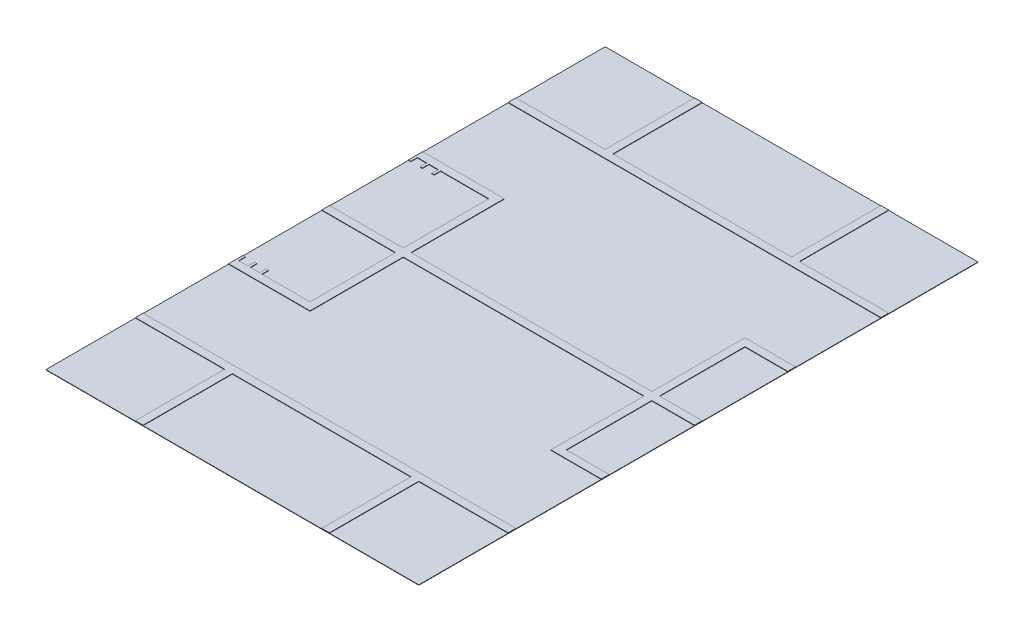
ISO-10303-21;
HEADER;
FILE_DESCRIPTION(('STEP AP214'),'2;1');
FILE_NAME('part.step','',(''),(''),'','','');
FILE_SCHEMA(('AUTOMOTIVE_DESIGN { 1 0 10303 214 1 1 1 1 }'));
ENDSEC;
DATA;
#1=APPLICATION_CONTEXT('core data for automotive mechanical design processes');
#2=APPLICATION_PROTOCOL_DEFINITION('international standard','automotive_design',2000,#1);
#3=PRODUCT_CONTEXT('',#1,'mechanical');
#4=PRODUCT('Part','Part','',(#3));
#5=PRODUCT_RELATED_PRODUCT_CATEGORY('part','',(#4));
#6=PRODUCT_DEFINITION_FORMATION('','',#4);
#7=PRODUCT_DEFINITION_CONTEXT('part definition',#1,'design');
#8=PRODUCT_DEFINITION('design','',#6,#7);
#9=PRODUCT_DEFINITION_SHAPE('','',#8);
#10=(LENGTH_UNIT() NAMED_UNIT(*) SI_UNIT(.MILLI.,.METRE.));
#11=(NAMED_UNIT(*) PLANE_ANGLE_UNIT() SI_UNIT($,.RADIAN.));
#12=(NAMED_UNIT(*) SI_UNIT($,.STERADIAN.) SOLID_ANGLE_UNIT());
#13=UNCERTAINTY_MEASURE_WITH_UNIT(LENGTH_MEASURE(1.E-05),#10,'distance_accuracy_value','');
#14=(GEOMETRIC_REPRESENTATION_CONTEXT(3) GLOBAL_UNCERTAINTY_ASSIGNED_CONTEXT((#13)) GLOBAL_UNIT_ASSIGNED_CONTEXT((#10,
#11,#12)) REPRESENTATION_CONTEXT('',''));
#15=CARTESIAN_POINT('',(0.,0.,0.));
#16=DIRECTION('',(0.,0.,1.));
#17=DIRECTION('',(1.,0.,0.));
#18=AXIS2_PLACEMENT_3D('',#15,#16,#17);
#19=CARTESIAN_POINT('',(0.,2.54,0.));
#20=DIRECTION('',(0.,-1.,0.));
#21=DIRECTION('',(0.,0.,-1.));
#22=AXIS2_PLACEMENT_3D('',#19,#20,#21);
#23=PLANE('',#22);
#24=DIRECTION('',(-1.,0.,0.));
#25=VECTOR('',#24,1.);
#26=CARTESIAN_POINT('',(0.,2.54,-2463.8));
#27=LINE('',#26,#25);
#28=CARTESIAN_POINT('',(2438.4,2.54,-2463.8));
#29=VERTEX_POINT('',#28);
#30=CARTESIAN_POINT('',(2108.2,2.54,-2463.8));
#31=VERTEX_POINT('',#30);
#32=EDGE_CURVE('E540',#29,#31,#27,.T.);
#33=ORIENTED_EDGE('',*,*,#32,.F.);
#34=DIRECTION('',(0.,0.,-1.));
#35=VECTOR('',#34,1.);
#36=CARTESIAN_POINT('',(2438.4,2.54,0.));
#37=LINE('',#36,#35);
#38=CARTESIAN_POINT('',(2438.4,2.54,-3022.6));
#39=VERTEX_POINT('',#38);
#40=EDGE_CURVE('E795',#29,#39,#37,.T.);
#41=ORIENTED_EDGE('',*,*,#40,.T.);
#42=DIRECTION('',(1.,0.,0.));
#43=VECTOR('',#42,1.);
#44=CARTESIAN_POINT('',(0.,2.54,-3022.6));
#45=LINE('',#44,#43);
#46=CARTESIAN_POINT('',(0.,2.54,-3022.6));
#47=VERTEX_POINT('',#46);
#48=EDGE_CURVE('E663',#47,#39,#45,.T.);
#49=ORIENTED_EDGE('',*,*,#48,.F.);
#50=DIRECTION('',(0.,0.,1.));
#51=VECTOR('',#50,1.);
#52=CARTESIAN_POINT('',(0.,2.54,0.));
#53=LINE('',#52,#51);
#54=CARTESIAN_POINT('',(0.,2.54,-2463.8));
#55=VERTEX_POINT('',#54);
#56=EDGE_CURVE('E783',#47,#55,#53,.T.);
#57=ORIENTED_EDGE('',*,*,#56,.T.);
#58=DIRECTION('',(1.,0.,0.));
#59=VECTOR('',#58,1.);
#60=CARTESIAN_POINT('',(0.,2.54,-2463.8));
#61=LINE('',#60,#59);
#62=CARTESIAN_POINT('',(533.4,2.54,-2463.8));
#63=VERTEX_POINT('',#62);
#64=EDGE_CURVE('E1102',#55,#63,#61,.T.);
#65=ORIENTED_EDGE('',*,*,#64,.T.);
#66=DIRECTION('',(0.,0.,-1.));
#67=VECTOR('',#66,1.);
#68=CARTESIAN_POINT('',(533.399999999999,2.54,0.));
#69=LINE('',#68,#67);
#70=CARTESIAN_POINT('',(533.4,2.54,-1854.2));
#71=VERTEX_POINT('',#70);
#72=EDGE_CURVE('E1093',#71,#63,#69,.T.);
#73=ORIENTED_EDGE('',*,*,#72,.F.);
#74=DIRECTION('',(1.,0.,0.));
#75=VECTOR('',#74,1.);
#76=CARTESIAN_POINT('',(-5.85876728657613E-13,2.54,-1854.2));
#77=LINE('',#76,#75);
#78=CARTESIAN_POINT('',(2108.2,2.54,-1854.2));
#79=VERTEX_POINT('',#78);
#80=EDGE_CURVE('E62',#71,#79,#77,.T.);
#81=ORIENTED_EDGE('',*,*,#80,.T.);
#82=DIRECTION('',(0.,0.,1.));
#83=VECTOR('',#82,1.);
#84=CARTESIAN_POINT('',(2108.2,2.54,0.));
#85=LINE('',#84,#83);
#86=EDGE_CURVE('E57',#31,#79,#85,.T.);
#87=ORIENTED_EDGE('',*,*,#86,.F.);
#88=EDGE_LOOP('',(#33,#41,#49,#57,#65,#73,#81,#87));
#89=FACE_BOUND('',#88,.T.);
#90=ADVANCED_FACE('F41',(#89),#23,.F.);
#91=DIRECTION('',(1.,0.,0.));
#92=VECTOR('',#91,1.);
#93=CARTESIAN_POINT('',(0.,2.54,-2370.1375));
#94=LINE('',#93,#92);
#95=CARTESIAN_POINT('',(0.,2.54,-2370.1375));
#96=VERTEX_POINT('',#95);
#97=CARTESIAN_POINT('',(15.8750000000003,2.54,-2370.1375));
#98=VERTEX_POINT('',#97);
#99=EDGE_CURVE('E1259',#96,#98,#94,.T.);
#100=ORIENTED_EDGE('',*,*,#99,.F.);
#101=CARTESIAN_POINT('',(0.,2.54,-1854.2));
#102=VERTEX_POINT('',#101);
#103=EDGE_CURVE('E1239',#96,#102,#53,.T.);
#104=ORIENTED_EDGE('',*,*,#103,.T.);
#105=CARTESIAN_POINT('',(482.6,2.54,-1854.2));
#106=VERTEX_POINT('',#105);
#107=EDGE_CURVE('E1099',#102,#106,#77,.T.);
#108=ORIENTED_EDGE('',*,*,#107,.T.);
#109=DIRECTION('',(0.,0.,-1.));
#110=VECTOR('',#109,1.);
#111=CARTESIAN_POINT('',(482.6,2.54,0.));
#112=LINE('',#111,#110);
#113=CARTESIAN_POINT('',(482.6,2.54,-2413.));
#114=VERTEX_POINT('',#113);
#115=EDGE_CURVE('E1107',#106,#114,#112,.T.);
#116=ORIENTED_EDGE('',*,*,#115,.T.);
#117=DIRECTION('',(1.,0.,0.));
#118=VECTOR('',#117,1.);
#119=CARTESIAN_POINT('',(0.,2.54,-2413.));
#120=LINE('',#119,#118);
#121=CARTESIAN_POINT('',(168.275,2.54,-2413.));
#122=VERTEX_POINT('',#121);
#123=EDGE_CURVE('E1116',#122,#114,#120,.T.);
#124=ORIENTED_EDGE('',*,*,#123,.F.);
#125=DIRECTION('',(0.,0.,1.));
#126=VECTOR('',#125,1.);
#127=CARTESIAN_POINT('',(168.274999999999,2.54,1.08966333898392E-13));
#128=LINE('',#127,#126);
#129=CARTESIAN_POINT('',(168.275,2.54,-2370.1375));
#130=VERTEX_POINT('',#129);
#131=EDGE_CURVE('E1121',#122,#130,#128,.T.);
#132=ORIENTED_EDGE('',*,*,#131,.T.);
#133=DIRECTION('',(1.,0.,0.));
#134=VECTOR('',#133,1.);
#135=CARTESIAN_POINT('',(0.,2.54,-2370.1375));
#136=LINE('',#135,#134);
#137=CARTESIAN_POINT('',(152.4,2.54,-2370.1375));
#138=VERTEX_POINT('',#137);
#139=EDGE_CURVE('E1284',#138,#130,#136,.T.);
#140=ORIENTED_EDGE('',*,*,#139,.F.);
#141=DIRECTION('',(0.,0.,1.));
#142=VECTOR('',#141,1.);
#143=CARTESIAN_POINT('',(152.4,2.54,0.));
#144=LINE('',#143,#142);
#145=CARTESIAN_POINT('',(152.4,2.54,-2413.));
#146=VERTEX_POINT('',#145);
#147=EDGE_CURVE('E1281',#146,#138,#144,.T.);
#148=ORIENTED_EDGE('',*,*,#147,.F.);
#149=CARTESIAN_POINT('',(92.0750000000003,2.54,-2413.));
#150=VERTEX_POINT('',#149);
#151=EDGE_CURVE('E1123',#150,#146,#120,.T.);
#152=ORIENTED_EDGE('',*,*,#151,.F.);
#153=DIRECTION('',(0.,0.,1.));
#154=VECTOR('',#153,1.);
#155=CARTESIAN_POINT('',(92.0750000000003,2.54,0.));
#156=LINE('',#155,#154);
#157=CARTESIAN_POINT('',(92.0750000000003,2.54,-2370.1375));
#158=VERTEX_POINT('',#157);
#159=EDGE_CURVE('E1278',#150,#158,#156,.T.);
#160=ORIENTED_EDGE('',*,*,#159,.T.);
#161=DIRECTION('',(1.,0.,0.));
#162=VECTOR('',#161,1.);
#163=CARTESIAN_POINT('',(0.,2.54,-2370.1375));
#164=LINE('',#163,#162);
#165=CARTESIAN_POINT('',(76.2000000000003,2.54,-2370.1375));
#166=VERTEX_POINT('',#165);
#167=EDGE_CURVE('E1274',#166,#158,#164,.T.);
#168=ORIENTED_EDGE('',*,*,#167,.F.);
#169=DIRECTION('',(0.,0.,1.));
#170=VECTOR('',#169,1.);
#171=CARTESIAN_POINT('',(76.2000000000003,2.54,0.));
#172=LINE('',#171,#170);
#173=CARTESIAN_POINT('',(76.2000000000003,2.54,-2413.));
#174=VERTEX_POINT('',#173);
#175=EDGE_CURVE('E1270',#174,#166,#172,.T.);
#176=ORIENTED_EDGE('',*,*,#175,.F.);
#177=CARTESIAN_POINT('',(15.8750000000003,2.54,-2413.));
#178=VERTEX_POINT('',#177);
#179=EDGE_CURVE('E1124',#178,#174,#120,.T.);
#180=ORIENTED_EDGE('',*,*,#179,.F.);
#181=DIRECTION('',(0.,0.,1.));
#182=VECTOR('',#181,1.);
#183=CARTESIAN_POINT('',(15.8750000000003,2.54,0.));
#184=LINE('',#183,#182);
#185=EDGE_CURVE('E1263',#178,#98,#184,.T.);
#186=ORIENTED_EDGE('',*,*,#185,.T.);
#187=EDGE_LOOP('',(#100,#104,#108,#116,#124,#132,#140,#148,#152,#160,#168,#176,#180,#186));
#188=FACE_BOUND('',#187,.T.);
#189=ADVANCED_FACE('F1291',(#188),#23,.F.);
#190=DIRECTION('',(1.,0.,0.));
#191=VECTOR('',#190,1.);
#192=CARTESIAN_POINT('',(0.,2.54,-1803.4));
#193=LINE('',#192,#191);
#194=CARTESIAN_POINT('',(0.,2.54,-1803.4));
#195=VERTEX_POINT('',#194);
#196=CARTESIAN_POINT('',(482.6,2.54,-1803.4));
#197=VERTEX_POINT('',#196);
#198=EDGE_CURVE('E1106',#195,#197,#193,.T.);
#199=ORIENTED_EDGE('',*,*,#198,.F.);
#200=CARTESIAN_POINT('',(0.,2.54,-1287.4625));
#201=VERTEX_POINT('',#200);
#202=EDGE_CURVE('E1235',#195,#201,#53,.T.);
#203=ORIENTED_EDGE('',*,*,#202,.T.);
#204=DIRECTION('',(1.,0.,0.));
#205=VECTOR('',#204,1.);
#206=CARTESIAN_POINT('',(0.,2.54,-1287.4625));
#207=LINE('',#206,#205);
#208=CARTESIAN_POINT('',(15.8750000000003,2.54,-1287.4625));
#209=VERTEX_POINT('',#208);
#210=EDGE_CURVE('E1160',#201,#209,#207,.T.);
#211=ORIENTED_EDGE('',*,*,#210,.T.);
#212=DIRECTION('',(0.,0.,-1.));
#213=VECTOR('',#212,1.);
#214=CARTESIAN_POINT('',(15.8750000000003,2.54,0.));
#215=LINE('',#214,#213);
#216=CARTESIAN_POINT('',(15.8750000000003,2.54,-1244.6));
#217=VERTEX_POINT('',#216);
#218=EDGE_CURVE('E1156',#217,#209,#215,.T.);
#219=ORIENTED_EDGE('',*,*,#218,.F.);
#220=DIRECTION('',(1.,0.,0.));
#221=VECTOR('',#220,1.);
#222=CARTESIAN_POINT('',(0.,2.54,-1244.6));
#223=LINE('',#222,#221);
#224=CARTESIAN_POINT('',(76.2000000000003,2.54,-1244.6));
#225=VERTEX_POINT('',#224);
#226=EDGE_CURVE('E1135',#217,#225,#223,.T.);
#227=ORIENTED_EDGE('',*,*,#226,.T.);
#228=DIRECTION('',(0.,0.,-1.));
#229=VECTOR('',#228,1.);
#230=CARTESIAN_POINT('',(76.2000000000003,2.54,0.));
#231=LINE('',#230,#229);
#232=CARTESIAN_POINT('',(76.2000000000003,2.54,-1287.4625));
#233=VERTEX_POINT('',#232);
#234=EDGE_CURVE('E1153',#225,#233,#231,.T.);
#235=ORIENTED_EDGE('',*,*,#234,.T.);
#236=DIRECTION('',(1.,0.,0.));
#237=VECTOR('',#236,1.);
#238=CARTESIAN_POINT('',(0.,2.54,-1287.4625));
#239=LINE('',#238,#237);
#240=CARTESIAN_POINT('',(92.0750000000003,2.54,-1287.4625));
#241=VERTEX_POINT('',#240);
#242=EDGE_CURVE('E1150',#233,#241,#239,.T.);
#243=ORIENTED_EDGE('',*,*,#242,.T.);
#244=DIRECTION('',(0.,0.,-1.));
#245=VECTOR('',#244,1.);
#246=CARTESIAN_POINT('',(92.0750000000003,2.54,0.));
#247=LINE('',#246,#245);
#248=CARTESIAN_POINT('',(92.0750000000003,2.54,-1244.6));
#249=VERTEX_POINT('',#248);
#250=EDGE_CURVE('E1146',#249,#241,#247,.T.);
#251=ORIENTED_EDGE('',*,*,#250,.F.);
#252=CARTESIAN_POINT('',(152.4,2.54,-1244.6));
#253=VERTEX_POINT('',#252);
#254=EDGE_CURVE('E1136',#249,#253,#223,.T.);
#255=ORIENTED_EDGE('',*,*,#254,.T.);
#256=DIRECTION('',(0.,0.,-1.));
#257=VECTOR('',#256,1.);
#258=CARTESIAN_POINT('',(152.4,2.54,0.));
#259=LINE('',#258,#257);
#260=CARTESIAN_POINT('',(152.4,2.54,-1287.4625));
#261=VERTEX_POINT('',#260);
#262=EDGE_CURVE('E1143',#253,#261,#259,.T.);
#263=ORIENTED_EDGE('',*,*,#262,.T.);
#264=DIRECTION('',(1.,0.,0.));
#265=VECTOR('',#264,1.);
#266=CARTESIAN_POINT('',(0.,2.54,-1287.4625));
#267=LINE('',#266,#265);
#268=CARTESIAN_POINT('',(168.275,2.54,-1287.4625));
#269=VERTEX_POINT('',#268);
#270=EDGE_CURVE('E1140',#261,#269,#267,.T.);
#271=ORIENTED_EDGE('',*,*,#270,.T.);
#272=DIRECTION('',(0.,0.,-1.));
#273=VECTOR('',#272,1.);
#274=CARTESIAN_POINT('',(168.275000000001,2.54,-1.08966333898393E-13));
#275=LINE('',#274,#273);
#276=CARTESIAN_POINT('',(168.275,2.54,-1244.6));
#277=VERTEX_POINT('',#276);
#278=EDGE_CURVE('E1134',#277,#269,#275,.T.);
#279=ORIENTED_EDGE('',*,*,#278,.F.);
#280=CARTESIAN_POINT('',(482.6,2.54,-1244.6));
#281=VERTEX_POINT('',#280);
#282=EDGE_CURVE('E1131',#277,#281,#223,.T.);
#283=ORIENTED_EDGE('',*,*,#282,.T.);
#284=DIRECTION('',(0.,0.,1.));
#285=VECTOR('',#284,1.);
#286=CARTESIAN_POINT('',(482.6,2.54,0.));
#287=LINE('',#286,#285);
#288=EDGE_CURVE('E1113',#197,#281,#287,.T.);
#289=ORIENTED_EDGE('',*,*,#288,.F.);
#290=EDGE_LOOP('',(#199,#203,#211,#219,#227,#235,#243,#251,#255,#263,#271,#279,#283,#289));
#291=FACE_BOUND('',#290,.T.);
#292=ADVANCED_FACE('F1193',(#291),#23,.F.);
#293=DIRECTION('',(1.,0.,0.));
#294=VECTOR('',#293,1.);
#295=CARTESIAN_POINT('',(0.,2.54,-1193.8));
#296=LINE('',#295,#294);
#297=CARTESIAN_POINT('',(0.,2.54,-1193.8));
#298=VERTEX_POINT('',#297);
#299=CARTESIAN_POINT('',(533.4,2.54,-1193.8));
#300=VERTEX_POINT('',#299);
#301=EDGE_CURVE('E1163',#298,#300,#296,.T.);
#302=ORIENTED_EDGE('',*,*,#301,.F.);
#303=CARTESIAN_POINT('',(0.,2.54,-635.));
#304=VERTEX_POINT('',#303);
#305=EDGE_CURVE('E784',#298,#304,#53,.T.);
#306=ORIENTED_EDGE('',*,*,#305,.T.);
#307=DIRECTION('',(1.,0.,0.));
#308=VECTOR('',#307,1.);
#309=CARTESIAN_POINT('',(0.,2.54,-635.));
#310=LINE('',#309,#308);
#311=CARTESIAN_POINT('',(2438.4,2.54,-635.));
#312=VERTEX_POINT('',#311);
#313=EDGE_CURVE('E593',#304,#312,#310,.T.);
#314=ORIENTED_EDGE('',*,*,#313,.T.);
#315=CARTESIAN_POINT('',(2438.4,2.54,-1193.8));
#316=VERTEX_POINT('',#315);
#317=EDGE_CURVE('E794',#312,#316,#37,.T.);
#318=ORIENTED_EDGE('',*,*,#317,.T.);
#319=DIRECTION('',(-1.,0.,0.));
#320=VECTOR('',#319,1.);
#321=CARTESIAN_POINT('',(0.,2.54,-1193.8));
#322=LINE('',#321,#320);
#323=CARTESIAN_POINT('',(2108.2,2.54,-1193.8));
#324=VERTEX_POINT('',#323);
#325=EDGE_CURVE('E1173',#316,#324,#322,.T.);
#326=ORIENTED_EDGE('',*,*,#325,.T.);
#327=DIRECTION('',(0.,0.,-1.));
#328=VECTOR('',#327,1.);
#329=CARTESIAN_POINT('',(2108.2,2.54,0.));
#330=LINE('',#329,#328);
#331=CARTESIAN_POINT('',(2108.2,2.54,-1803.4));
#332=VERTEX_POINT('',#331);
#333=EDGE_CURVE('E1170',#324,#332,#330,.T.);
#334=ORIENTED_EDGE('',*,*,#333,.T.);
#335=CARTESIAN_POINT('',(533.4,2.54,-1803.4));
#336=VERTEX_POINT('',#335);
#337=EDGE_CURVE('E1115',#336,#332,#193,.T.);
#338=ORIENTED_EDGE('',*,*,#337,.F.);
#339=DIRECTION('',(0.,0.,1.));
#340=VECTOR('',#339,1.);
#341=CARTESIAN_POINT('',(533.400000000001,2.54,0.));
#342=LINE('',#341,#340);
#343=EDGE_CURVE('E1167',#336,#300,#342,.T.);
#344=ORIENTED_EDGE('',*,*,#343,.T.);
#345=EDGE_LOOP('',(#302,#306,#314,#318,#326,#334,#338,#344));
#346=FACE_BOUND('',#345,.T.);
#347=ADVANCED_FACE('F1484',(#346),#23,.F.);
#348=DIRECTION('',(-1.,0.,0.));
#349=VECTOR('',#348,1.);
#350=CARTESIAN_POINT('',(0.,2.54,-1244.6));
#351=LINE('',#350,#349);
#352=CARTESIAN_POINT('',(2438.4,2.54,-1244.6));
#353=VERTEX_POINT('',#352);
#354=CARTESIAN_POINT('',(2159.,2.54,-1244.6));
#355=VERTEX_POINT('',#354);
#356=EDGE_CURVE('E1176',#353,#355,#351,.T.);
#357=ORIENTED_EDGE('',*,*,#356,.F.);
#358=CARTESIAN_POINT('',(2438.4,2.54,-1803.4));
#359=VERTEX_POINT('',#358);
#360=EDGE_CURVE('E883',#353,#359,#37,.T.);
#361=ORIENTED_EDGE('',*,*,#360,.T.);
#362=DIRECTION('',(1.,0.,0.));
#363=VECTOR('',#362,1.);
#364=CARTESIAN_POINT('',(4.29959098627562E-12,2.54,-1803.40000000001));
#365=LINE('',#364,#363);
#366=CARTESIAN_POINT('',(2159.,2.54,-1803.4));
#367=VERTEX_POINT('',#366);
#368=EDGE_CURVE('E1184',#367,#359,#365,.T.);
#369=ORIENTED_EDGE('',*,*,#368,.F.);
#370=DIRECTION('',(0.,0.,-1.));
#371=VECTOR('',#370,1.);
#372=CARTESIAN_POINT('',(2159.,2.54,0.));
#373=LINE('',#372,#371);
#374=EDGE_CURVE('E1180',#355,#367,#373,.T.);
#375=ORIENTED_EDGE('',*,*,#374,.F.);
#376=EDGE_LOOP('',(#357,#361,#369,#375));
#377=FACE_BOUND('',#376,.T.);
#378=ADVANCED_FACE('F1486',(#377),#23,.F.);
#379=DIRECTION('',(1.,0.,0.));
#380=VECTOR('',#379,1.);
#381=CARTESIAN_POINT('',(0.,2.54,-584.2));
#382=LINE('',#381,#380);
#383=CARTESIAN_POINT('',(1854.2,2.54,-584.2));
#384=VERTEX_POINT('',#383);
#385=CARTESIAN_POINT('',(2438.4,2.54,-584.2));
#386=VERTEX_POINT('',#385);
#387=EDGE_CURVE('E546',#384,#386,#382,.T.);
#388=ORIENTED_EDGE('',*,*,#387,.F.);
#389=DIRECTION('',(0.,0.,1.));
#390=VECTOR('',#389,1.);
#391=CARTESIAN_POINT('',(1854.2,2.54,0.));
#392=LINE('',#391,#390);
#393=CARTESIAN_POINT('',(1854.2,2.54,0.));
#394=VERTEX_POINT('',#393);
#395=EDGE_CURVE('E542',#384,#394,#392,.T.);
#396=ORIENTED_EDGE('',*,*,#395,.T.);
#397=DIRECTION('',(1.,0.,0.));
#398=VECTOR('',#397,1.);
#399=CARTESIAN_POINT('',(0.,2.54,0.));
#400=LINE('',#399,#398);
#401=CARTESIAN_POINT('',(2438.4,2.54,0.));
#402=VERTEX_POINT('',#401);
#403=EDGE_CURVE('E782',#394,#402,#400,.T.);
#404=ORIENTED_EDGE('',*,*,#403,.T.);
#405=EDGE_CURVE('E790',#402,#386,#37,.T.);
#406=ORIENTED_EDGE('',*,*,#405,.T.);
#407=EDGE_LOOP('',(#388,#396,#404,#406));
#408=FACE_BOUND('',#407,.T.);
#409=ADVANCED_FACE('F1452',(#408),#23,.F.);
#410=DIRECTION('',(1.,0.,0.));
#411=VECTOR('',#410,1.);
#412=CARTESIAN_POINT('',(0.,2.54,-584.2));
#413=LINE('',#412,#411);
#414=CARTESIAN_POINT('',(0.,2.54,-584.2));
#415=VERTEX_POINT('',#414);
#416=CARTESIAN_POINT('',(584.2,2.54,-584.2));
#417=VERTEX_POINT('',#416);
#418=EDGE_CURVE('E597',#415,#417,#413,.T.);
#419=ORIENTED_EDGE('',*,*,#418,.F.);
#420=CARTESIAN_POINT('',(0.,2.54,0.));
#421=VERTEX_POINT('',#420);
#422=EDGE_CURVE('E813',#415,#421,#53,.T.);
#423=ORIENTED_EDGE('',*,*,#422,.T.);
#424=CARTESIAN_POINT('',(584.2,2.54,0.));
#425=VERTEX_POINT('',#424);
#426=EDGE_CURVE('E785',#421,#425,#400,.T.);
#427=ORIENTED_EDGE('',*,*,#426,.T.);
#428=DIRECTION('',(0.,0.,-1.));
#429=VECTOR('',#428,1.);
#430=CARTESIAN_POINT('',(584.2,2.54,0.));
#431=LINE('',#430,#429);
#432=EDGE_CURVE('E601',#425,#417,#431,.T.);
#433=ORIENTED_EDGE('',*,*,#432,.T.);
#434=EDGE_LOOP('',(#419,#423,#427,#433));
#435=FACE_BOUND('',#434,.T.);
#436=ADVANCED_FACE('F1447',(#435),#23,.F.);
#437=DIRECTION('',(0.,0.,-1.));
#438=VECTOR('',#437,1.);
#439=CARTESIAN_POINT('',(635.,2.54,0.));
#440=LINE('',#439,#438);
#441=CARTESIAN_POINT('',(635.,2.54,0.));
#442=VERTEX_POINT('',#441);
#443=CARTESIAN_POINT('',(635.,2.54,-584.2));
#444=VERTEX_POINT('',#443);
#445=EDGE_CURVE('E604',#442,#444,#440,.T.);
#446=ORIENTED_EDGE('',*,*,#445,.F.);
#447=CARTESIAN_POINT('',(1803.4,2.54,0.));
#448=VERTEX_POINT('',#447);
#449=EDGE_CURVE('E789',#442,#448,#400,.T.);
#450=ORIENTED_EDGE('',*,*,#449,.T.);
#451=DIRECTION('',(0.,0.,1.));
#452=VECTOR('',#451,1.);
#453=CARTESIAN_POINT('',(1803.4,2.54,0.));
#454=LINE('',#453,#452);
#455=CARTESIAN_POINT('',(1803.4,2.54,-584.2));
#456=VERTEX_POINT('',#455);
#457=EDGE_CURVE('E557',#456,#448,#454,.T.);
#458=ORIENTED_EDGE('',*,*,#457,.F.);
#459=DIRECTION('',(1.,0.,0.));
#460=VECTOR('',#459,1.);
#461=CARTESIAN_POINT('',(0.,2.54,-584.2));
#462=LINE('',#461,#460);
#463=EDGE_CURVE('E608',#444,#456,#462,.T.);
#464=ORIENTED_EDGE('',*,*,#463,.F.);
#465=EDGE_LOOP('',(#446,#450,#458,#464));
#466=FACE_BOUND('',#465,.T.);
#467=ADVANCED_FACE('F1443',(#466),#23,.F.);
#468=CARTESIAN_POINT('',(0.,2.54,-3657.6));
#469=VERTEX_POINT('',#468);
#470=CARTESIAN_POINT('',(0.,2.54,-3073.4));
#471=VERTEX_POINT('',#470);
#472=EDGE_CURVE('E779',#469,#471,#53,.T.);
#473=ORIENTED_EDGE('',*,*,#472,.T.);
#474=DIRECTION('',(1.,0.,0.));
#475=VECTOR('',#474,1.);
#476=CARTESIAN_POINT('',(0.,2.54,-3073.4));
#477=LINE('',#476,#475);
#478=CARTESIAN_POINT('',(584.2,2.54,-3073.4));
#479=VERTEX_POINT('',#478);
#480=EDGE_CURVE('E669',#471,#479,#477,.T.);
#481=ORIENTED_EDGE('',*,*,#480,.T.);
#482=DIRECTION('',(0.,0.,1.));
#483=VECTOR('',#482,1.);
#484=CARTESIAN_POINT('',(584.2,2.54,0.));
#485=LINE('',#484,#483);
#486=CARTESIAN_POINT('',(584.2,2.54,-3657.6));
#487=VERTEX_POINT('',#486);
#488=EDGE_CURVE('E725',#487,#479,#485,.T.);
#489=ORIENTED_EDGE('',*,*,#488,.F.);
#490=DIRECTION('',(-1.,0.,0.));
#491=VECTOR('',#490,1.);
#492=CARTESIAN_POINT('',(0.,2.54,-3657.6));
#493=LINE('',#492,#491);
#494=EDGE_CURVE('E793',#487,#469,#493,.T.);
#495=ORIENTED_EDGE('',*,*,#494,.T.);
#496=EDGE_LOOP('',(#473,#481,#489,#495));
#497=FACE_BOUND('',#496,.T.);
#498=ADVANCED_FACE('F845',(#497),#23,.F.);
#499=DIRECTION('',(0.,0.,-1.));
#500=VECTOR('',#499,1.);
#501=CARTESIAN_POINT('',(1854.2,2.54,0.));
#502=LINE('',#501,#500);
#503=CARTESIAN_POINT('',(1854.2,2.54,-3073.4));
#504=VERTEX_POINT('',#503);
#505=CARTESIAN_POINT('',(1854.2,2.54,-3657.6));
#506=VERTEX_POINT('',#505);
#507=EDGE_CURVE('E712',#504,#506,#502,.T.);
#508=ORIENTED_EDGE('',*,*,#507,.F.);
#509=DIRECTION('',(1.,0.,0.));
#510=VECTOR('',#509,1.);
#511=CARTESIAN_POINT('',(0.,2.54,-3073.4));
#512=LINE('',#511,#510);
#513=CARTESIAN_POINT('',(2438.4,2.54,-3073.4));
#514=VERTEX_POINT('',#513);
#515=EDGE_CURVE('E709',#504,#514,#512,.T.);
#516=ORIENTED_EDGE('',*,*,#515,.T.);
#517=CARTESIAN_POINT('',(2438.4,2.54,-3657.6));
#518=VERTEX_POINT('',#517);
#519=EDGE_CURVE('E788',#514,#518,#37,.T.);
#520=ORIENTED_EDGE('',*,*,#519,.T.);
#521=EDGE_CURVE('E796',#518,#506,#493,.T.);
#522=ORIENTED_EDGE('',*,*,#521,.T.);
#523=EDGE_LOOP('',(#508,#516,#520,#522));
#524=FACE_BOUND('',#523,.T.);
#525=ADVANCED_FACE('F876',(#524),#23,.F.);
#526=DIRECTION('',(0.,0.,1.));
#527=VECTOR('',#526,1.);
#528=CARTESIAN_POINT('',(2159.,2.54,0.));
#529=LINE('',#528,#527);
#530=CARTESIAN_POINT('',(2159.,2.54,-2413.));
#531=VERTEX_POINT('',#530);
#532=CARTESIAN_POINT('',(2159.,2.54,-1854.2));
#533=VERTEX_POINT('',#532);
#534=EDGE_CURVE('E911',#531,#533,#529,.T.);
#535=ORIENTED_EDGE('',*,*,#534,.T.);
#536=DIRECTION('',(1.,0.,0.));
#537=VECTOR('',#536,1.);
#538=CARTESIAN_POINT('',(-5.8942749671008E-12,2.54,-1854.19999999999));
#539=LINE('',#538,#537);
#540=CARTESIAN_POINT('',(2438.4,2.54,-1854.2));
#541=VERTEX_POINT('',#540);
#542=EDGE_CURVE('E898',#533,#541,#539,.T.);
#543=ORIENTED_EDGE('',*,*,#542,.T.);
#544=CARTESIAN_POINT('',(2438.4,2.54,-2413.));
#545=VERTEX_POINT('',#544);
#546=EDGE_CURVE('E881',#541,#545,#37,.T.);
#547=ORIENTED_EDGE('',*,*,#546,.T.);
#548=DIRECTION('',(-1.,0.,0.));
#549=VECTOR('',#548,1.);
#550=CARTESIAN_POINT('',(0.,2.54,-2413.));
#551=LINE('',#550,#549);
#552=EDGE_CURVE('E537',#545,#531,#551,.T.);
#553=ORIENTED_EDGE('',*,*,#552,.T.);
#554=EDGE_LOOP('',(#535,#543,#547,#553));
#555=FACE_BOUND('',#554,.T.);
#556=ADVANCED_FACE('F894',(#555),#23,.F.);
#557=CARTESIAN_POINT('',(0.,2.54,0.));
#558=DIRECTION('',(1.,0.,0.));
#559=DIRECTION('',(0.,0.,-1.));
#560=AXIS2_PLACEMENT_3D('',#557,#558,#559);
#561=PLANE('',#560);
#562=DIRECTION('',(0.,0.,1.));
#563=VECTOR('',#562,1.);
#564=CARTESIAN_POINT('',(0.,0.,0.));
#565=LINE('',#564,#563);
#566=CARTESIAN_POINT('',(0.,0.,-3657.6));
#567=VERTEX_POINT('',#566);
#568=CARTESIAN_POINT('',(0.,0.,0.));
#569=VERTEX_POINT('',#568);
#570=EDGE_CURVE('E778',#567,#569,#565,.T.);
#571=ORIENTED_EDGE('',*,*,#570,.T.);
#572=DIRECTION('',(0.,-1.,0.));
#573=VECTOR('',#572,1.);
#574=CARTESIAN_POINT('',(0.,2.54,0.));
#575=LINE('',#574,#573);
#576=EDGE_CURVE('E11',#421,#569,#575,.T.);
#577=ORIENTED_EDGE('',*,*,#576,.F.);
#578=ORIENTED_EDGE('',*,*,#422,.F.);
#579=DIRECTION('',(0.,-1.,0.));
#580=VECTOR('',#579,1.);
#581=CARTESIAN_POINT('',(0.,5.08,-584.2));
#582=LINE('',#581,#580);
#583=CARTESIAN_POINT('',(0.,5.08,-584.2));
#584=VERTEX_POINT('',#583);
#585=EDGE_CURVE('E643',#584,#415,#582,.T.);
#586=ORIENTED_EDGE('',*,*,#585,.F.);
#587=DIRECTION('',(0.,0.,1.));
#588=VECTOR('',#587,1.);
#589=CARTESIAN_POINT('',(0.,5.08,0.));
#590=LINE('',#589,#588);
#591=CARTESIAN_POINT('',(0.,5.08,-635.));
#592=VERTEX_POINT('',#591);
#593=EDGE_CURVE('E567',#592,#584,#590,.T.);
#594=ORIENTED_EDGE('',*,*,#593,.F.);
#595=DIRECTION('',(0.,-1.,0.));
#596=VECTOR('',#595,1.);
#597=CARTESIAN_POINT('',(0.,5.08,-635.));
#598=LINE('',#597,#596);
#599=EDGE_CURVE('E647',#592,#304,#598,.T.);
#600=ORIENTED_EDGE('',*,*,#599,.T.);
#601=ORIENTED_EDGE('',*,*,#305,.F.);
#602=DIRECTION('',(0.,-1.,0.));
#603=VECTOR('',#602,1.);
#604=CARTESIAN_POINT('',(0.,5.08,-1193.8));
#605=LINE('',#604,#603);
#606=CARTESIAN_POINT('',(0.,5.08,-1193.8));
#607=VERTEX_POINT('',#606);
#608=EDGE_CURVE('E963',#607,#298,#605,.T.);
#609=ORIENTED_EDGE('',*,*,#608,.F.);
#610=DIRECTION('',(0.,0.,1.));
#611=VECTOR('',#610,1.);
#612=CARTESIAN_POINT('',(0.,5.08,0.));
#613=LINE('',#612,#611);
#614=CARTESIAN_POINT('',(0.,5.08,-1287.4625));
#615=VERTEX_POINT('',#614);
#616=EDGE_CURVE('E1353',#615,#607,#613,.T.);
#617=ORIENTED_EDGE('',*,*,#616,.F.);
#618=DIRECTION('',(0.,-1.,0.));
#619=VECTOR('',#618,1.);
#620=CARTESIAN_POINT('',(0.,5.08,-1287.4625));
#621=LINE('',#620,#619);
#622=EDGE_CURVE('E967',#615,#201,#621,.T.);
#623=ORIENTED_EDGE('',*,*,#622,.T.);
#624=ORIENTED_EDGE('',*,*,#202,.F.);
#625=DIRECTION('',(0.,-1.,0.));
#626=VECTOR('',#625,1.);
#627=CARTESIAN_POINT('',(0.,5.08,-1803.4));
#628=LINE('',#627,#626);
#629=CARTESIAN_POINT('',(0.,5.08,-1803.4));
#630=VERTEX_POINT('',#629);
#631=EDGE_CURVE('E1019',#630,#195,#628,.T.);
#632=ORIENTED_EDGE('',*,*,#631,.F.);
#633=DIRECTION('',(0.,0.,1.));
#634=VECTOR('',#633,1.);
#635=CARTESIAN_POINT('',(0.,5.08,0.));
#636=LINE('',#635,#634);
#637=CARTESIAN_POINT('',(0.,5.08,-1854.2));
#638=VERTEX_POINT('',#637);
#639=EDGE_CURVE('E1233',#638,#630,#636,.T.);
#640=ORIENTED_EDGE('',*,*,#639,.F.);
#641=DIRECTION('',(0.,-1.,0.));
#642=VECTOR('',#641,1.);
#643=CARTESIAN_POINT('',(0.,5.08,-1854.2));
#644=LINE('',#643,#642);
#645=EDGE_CURVE('E1023',#638,#102,#644,.T.);
#646=ORIENTED_EDGE('',*,*,#645,.T.);
#647=ORIENTED_EDGE('',*,*,#103,.F.);
#648=DIRECTION('',(0.,-1.,0.));
#649=VECTOR('',#648,1.);
#650=CARTESIAN_POINT('',(0.,5.08,-2370.1375));
#651=LINE('',#650,#649);
#652=CARTESIAN_POINT('',(0.,5.08,-2370.1375));
#653=VERTEX_POINT('',#652);
#654=EDGE_CURVE('E1075',#653,#96,#651,.T.);
#655=ORIENTED_EDGE('',*,*,#654,.F.);
#656=DIRECTION('',(0.,0.,1.));
#657=VECTOR('',#656,1.);
#658=CARTESIAN_POINT('',(0.,5.08,0.));
#659=LINE('',#658,#657);
#660=CARTESIAN_POINT('',(0.,5.08,-2463.8));
#661=VERTEX_POINT('',#660);
#662=EDGE_CURVE('E1253',#661,#653,#659,.T.);
#663=ORIENTED_EDGE('',*,*,#662,.F.);
#664=DIRECTION('',(0.,-1.,0.));
#665=VECTOR('',#664,1.);
#666=CARTESIAN_POINT('',(0.,5.08,-2463.8));
#667=LINE('',#666,#665);
#668=EDGE_CURVE('E1079',#661,#55,#667,.T.);
#669=ORIENTED_EDGE('',*,*,#668,.T.);
#670=ORIENTED_EDGE('',*,*,#56,.F.);
#671=DIRECTION('',(0.,-1.,0.));
#672=VECTOR('',#671,1.);
#673=CARTESIAN_POINT('',(0.,5.08,-3022.6));
#674=LINE('',#673,#672);
#675=CARTESIAN_POINT('',(0.,5.08,-3022.6));
#676=VERTEX_POINT('',#675);
#677=EDGE_CURVE('E774',#676,#47,#674,.T.);
#678=ORIENTED_EDGE('',*,*,#677,.F.);
#679=DIRECTION('',(0.,0.,1.));
#680=VECTOR('',#679,1.);
#681=CARTESIAN_POINT('',(0.,5.08,0.));
#682=LINE('',#681,#680);
#683=CARTESIAN_POINT('',(0.,5.08,-3073.4));
#684=VERTEX_POINT('',#683);
#685=EDGE_CURVE('E664',#684,#676,#682,.T.);
#686=ORIENTED_EDGE('',*,*,#685,.F.);
#687=DIRECTION('',(0.,-1.,0.));
#688=VECTOR('',#687,1.);
#689=CARTESIAN_POINT('',(0.,5.08,-3073.4));
#690=LINE('',#689,#688);
#691=EDGE_CURVE('E705',#684,#471,#690,.T.);
#692=ORIENTED_EDGE('',*,*,#691,.T.);
#693=ORIENTED_EDGE('',*,*,#472,.F.);
#694=DIRECTION('',(0.,-1.,0.));
#695=VECTOR('',#694,1.);
#696=CARTESIAN_POINT('',(0.,2.54,-3657.6));
#697=LINE('',#696,#695);
#698=EDGE_CURVE('E799',#469,#567,#697,.T.);
#699=ORIENTED_EDGE('',*,*,#698,.T.);
#700=EDGE_LOOP('',(#571,#577,#578,#586,#594,#600,#601,#609,#617,#623,#624,#632,#640,#646,#647,
#655,#663,#669,#670,#678,#686,#692,#693,#699));
#701=FACE_BOUND('',#700,.T.);
#702=ADVANCED_FACE('F43',(#701),#561,.F.);
#703=CARTESIAN_POINT('',(0.,2.54,0.));
#704=DIRECTION('',(0.,0.,-1.));
#705=DIRECTION('',(-1.,0.,0.));
#706=AXIS2_PLACEMENT_3D('',#703,#704,#705);
#707=PLANE('',#706);
#708=DIRECTION('',(1.,0.,0.));
#709=VECTOR('',#708,1.);
#710=CARTESIAN_POINT('',(0.,0.,0.));
#711=LINE('',#710,#709);
#712=CARTESIAN_POINT('',(2438.4,0.,0.));
#713=VERTEX_POINT('',#712);
#714=EDGE_CURVE('E804',#569,#713,#711,.T.);
#715=ORIENTED_EDGE('',*,*,#714,.T.);
#716=DIRECTION('',(0.,-1.,0.));
#717=VECTOR('',#716,1.);
#718=CARTESIAN_POINT('',(2438.4,2.54,0.));
#719=LINE('',#718,#717);
#720=EDGE_CURVE('E50',#402,#713,#719,.T.);
#721=ORIENTED_EDGE('',*,*,#720,.F.);
#722=ORIENTED_EDGE('',*,*,#403,.F.);
#723=DIRECTION('',(0.,-1.,0.));
#724=VECTOR('',#723,1.);
#725=CARTESIAN_POINT('',(1854.2,5.08,0.));
#726=LINE('',#725,#724);
#727=CARTESIAN_POINT('',(1854.2,5.08,0.));
#728=VERTEX_POINT('',#727);
#729=EDGE_CURVE('E615',#728,#394,#726,.T.);
#730=ORIENTED_EDGE('',*,*,#729,.F.);
#731=DIRECTION('',(1.,0.,0.));
#732=VECTOR('',#731,1.);
#733=CARTESIAN_POINT('',(0.,5.08,0.));
#734=LINE('',#733,#732);
#735=CARTESIAN_POINT('',(1803.4,5.08,0.));
#736=VERTEX_POINT('',#735);
#737=EDGE_CURVE('E581',#736,#728,#734,.T.);
#738=ORIENTED_EDGE('',*,*,#737,.F.);
#739=DIRECTION('',(0.,-1.,0.));
#740=VECTOR('',#739,1.);
#741=CARTESIAN_POINT('',(1803.4,5.08,0.));
#742=LINE('',#741,#740);
#743=EDGE_CURVE('E619',#736,#448,#742,.T.);
#744=ORIENTED_EDGE('',*,*,#743,.T.);
#745=ORIENTED_EDGE('',*,*,#449,.F.);
#746=DIRECTION('',(0.,-1.,0.));
#747=VECTOR('',#746,1.);
#748=CARTESIAN_POINT('',(635.,5.08,0.));
#749=LINE('',#748,#747);
#750=CARTESIAN_POINT('',(635.,5.08,0.));
#751=VERTEX_POINT('',#750);
#752=EDGE_CURVE('E631',#751,#442,#749,.T.);
#753=ORIENTED_EDGE('',*,*,#752,.F.);
#754=CARTESIAN_POINT('',(584.2,5.08,0.));
#755=VERTEX_POINT('',#754);
#756=EDGE_CURVE('E577',#755,#751,#734,.T.);
#757=ORIENTED_EDGE('',*,*,#756,.F.);
#758=DIRECTION('',(0.,-1.,0.));
#759=VECTOR('',#758,1.);
#760=CARTESIAN_POINT('',(584.2,5.08,0.));
#761=LINE('',#760,#759);
#762=EDGE_CURVE('E635',#755,#425,#761,.T.);
#763=ORIENTED_EDGE('',*,*,#762,.T.);
#764=ORIENTED_EDGE('',*,*,#426,.F.);
#765=ORIENTED_EDGE('',*,*,#576,.T.);
#766=EDGE_LOOP('',(#715,#721,#722,#730,#738,#744,#745,#753,#757,#763,#764,#765));
#767=FACE_BOUND('',#766,.T.);
#768=ADVANCED_FACE('F1439',(#767),#707,.F.);
#769=CARTESIAN_POINT('',(2438.4,2.54,0.));
#770=DIRECTION('',(-1.,0.,0.));
#771=DIRECTION('',(0.,0.,1.));
#772=AXIS2_PLACEMENT_3D('',#769,#770,#771);
#773=PLANE('',#772);
#774=DIRECTION('',(0.,0.,-1.));
#775=VECTOR('',#774,1.);
#776=CARTESIAN_POINT('',(2438.4,0.,0.));
#777=LINE('',#776,#775);
#778=CARTESIAN_POINT('',(2438.4,0.,-3657.6));
#779=VERTEX_POINT('',#778);
#780=EDGE_CURVE('E807',#713,#779,#777,.T.);
#781=ORIENTED_EDGE('',*,*,#780,.T.);
#782=DIRECTION('',(0.,-1.,0.));
#783=VECTOR('',#782,1.);
#784=CARTESIAN_POINT('',(2438.4,2.54,-3657.6));
#785=LINE('',#784,#783);
#786=EDGE_CURVE('E817',#518,#779,#785,.T.);
#787=ORIENTED_EDGE('',*,*,#786,.F.);
#788=ORIENTED_EDGE('',*,*,#519,.F.);
#789=DIRECTION('',(0.,-1.,0.));
#790=VECTOR('',#789,1.);
#791=CARTESIAN_POINT('',(2438.4,5.08,-3073.4));
#792=LINE('',#791,#790);
#793=CARTESIAN_POINT('',(2438.4,5.08,-3073.4));
#794=VERTEX_POINT('',#793);
#795=EDGE_CURVE('E766',#794,#514,#792,.T.);
#796=ORIENTED_EDGE('',*,*,#795,.F.);
#797=DIRECTION('',(0.,0.,-1.));
#798=VECTOR('',#797,1.);
#799=CARTESIAN_POINT('',(2438.4,5.08,0.));
#800=LINE('',#799,#798);
#801=CARTESIAN_POINT('',(2438.4,5.08,-3022.6));
#802=VERTEX_POINT('',#801);
#803=EDGE_CURVE('E672',#802,#794,#800,.T.);
#804=ORIENTED_EDGE('',*,*,#803,.F.);
#805=DIRECTION('',(0.,-1.,0.));
#806=VECTOR('',#805,1.);
#807=CARTESIAN_POINT('',(2438.4,5.08,-3022.6));
#808=LINE('',#807,#806);
#809=EDGE_CURVE('E770',#802,#39,#808,.T.);
#810=ORIENTED_EDGE('',*,*,#809,.T.);
#811=ORIENTED_EDGE('',*,*,#40,.F.);
#812=DIRECTION('',(0.,-1.,0.));
#813=VECTOR('',#812,1.);
#814=CARTESIAN_POINT('',(2438.4,5.08,-2463.8));
#815=LINE('',#814,#813);
#816=CARTESIAN_POINT('',(2438.4,5.08,-2463.8));
#817=VERTEX_POINT('',#816);
#818=EDGE_CURVE('E906',#817,#29,#815,.T.);
#819=ORIENTED_EDGE('',*,*,#818,.F.);
#820=DIRECTION('',(0.,0.,-1.));
#821=VECTOR('',#820,1.);
#822=CARTESIAN_POINT('',(2438.4,5.08,0.));
#823=LINE('',#822,#821);
#824=CARTESIAN_POINT('',(2438.4,5.08,-2413.));
#825=VERTEX_POINT('',#824);
#826=EDGE_CURVE('E532',#825,#817,#823,.T.);
#827=ORIENTED_EDGE('',*,*,#826,.F.);
#828=DIRECTION('',(0.,-1.,0.));
#829=VECTOR('',#828,1.);
#830=CARTESIAN_POINT('',(2438.4,5.08,-2413.));
#831=LINE('',#830,#829);
#832=EDGE_CURVE('E901',#825,#545,#831,.T.);
#833=ORIENTED_EDGE('',*,*,#832,.T.);
#834=ORIENTED_EDGE('',*,*,#546,.F.);
#835=DIRECTION('',(0.,-1.,0.));
#836=VECTOR('',#835,1.);
#837=CARTESIAN_POINT('',(2438.4,5.08,-1854.2));
#838=LINE('',#837,#836);
#839=CARTESIAN_POINT('',(2438.4,5.08,-1854.2));
#840=VERTEX_POINT('',#839);
#841=EDGE_CURVE('E925',#840,#541,#838,.T.);
#842=ORIENTED_EDGE('',*,*,#841,.F.);
#843=CARTESIAN_POINT('',(2438.4,5.08,-1803.4));
#844=VERTEX_POINT('',#843);
#845=EDGE_CURVE('E1375',#844,#840,#823,.T.);
#846=ORIENTED_EDGE('',*,*,#845,.F.);
#847=DIRECTION('',(0.,-1.,0.));
#848=VECTOR('',#847,1.);
#849=CARTESIAN_POINT('',(2438.4,5.08,-1803.4));
#850=LINE('',#849,#848);
#851=EDGE_CURVE('E928',#844,#359,#850,.T.);
#852=ORIENTED_EDGE('',*,*,#851,.T.);
#853=ORIENTED_EDGE('',*,*,#360,.F.);
#854=DIRECTION('',(0.,-1.,0.));
#855=VECTOR('',#854,1.);
#856=CARTESIAN_POINT('',(2438.4,5.08,-1244.6));
#857=LINE('',#856,#855);
#858=CARTESIAN_POINT('',(2438.4,5.08,-1244.6));
#859=VERTEX_POINT('',#858);
#860=EDGE_CURVE('E940',#859,#353,#857,.T.);
#861=ORIENTED_EDGE('',*,*,#860,.F.);
#862=CARTESIAN_POINT('',(2438.4,5.08,-1193.8));
#863=VERTEX_POINT('',#862);
#864=EDGE_CURVE('E1371',#863,#859,#823,.T.);
#865=ORIENTED_EDGE('',*,*,#864,.F.);
#866=DIRECTION('',(0.,-1.,0.));
#867=VECTOR('',#866,1.);
#868=CARTESIAN_POINT('',(2438.4,5.08,-1193.8));
#869=LINE('',#868,#867);
#870=EDGE_CURVE('E944',#863,#316,#869,.T.);
#871=ORIENTED_EDGE('',*,*,#870,.T.);
#872=ORIENTED_EDGE('',*,*,#317,.F.);
#873=DIRECTION('',(0.,-1.,0.));
#874=VECTOR('',#873,1.);
#875=CARTESIAN_POINT('',(2438.4,5.08,-635.));
#876=LINE('',#875,#874);
#877=CARTESIAN_POINT('',(2438.4,5.08,-635.));
#878=VERTEX_POINT('',#877);
#879=EDGE_CURVE('E651',#878,#312,#876,.T.);
#880=ORIENTED_EDGE('',*,*,#879,.F.);
#881=DIRECTION('',(0.,0.,-1.));
#882=VECTOR('',#881,1.);
#883=CARTESIAN_POINT('',(2438.4,5.08,0.));
#884=LINE('',#883,#882);
#885=CARTESIAN_POINT('',(2438.4,5.08,-584.2));
#886=VERTEX_POINT('',#885);
#887=EDGE_CURVE('E560',#886,#878,#884,.T.);
#888=ORIENTED_EDGE('',*,*,#887,.F.);
#889=DIRECTION('',(0.,-1.,0.));
#890=VECTOR('',#889,1.);
#891=CARTESIAN_POINT('',(2438.4,5.08,-584.2));
#892=LINE('',#891,#890);
#893=EDGE_CURVE('E655',#886,#386,#892,.T.);
#894=ORIENTED_EDGE('',*,*,#893,.T.);
#895=ORIENTED_EDGE('',*,*,#405,.F.);
#896=ORIENTED_EDGE('',*,*,#720,.T.);
#897=EDGE_LOOP('',(#781,#787,#788,#796,#804,#810,#811,#819,#827,#833,#834,#842,#846,#852,#853,
#861,#865,#871,#872,#880,#888,#894,#895,#896));
#898=FACE_BOUND('',#897,.T.);
#899=ADVANCED_FACE('F826',(#898),#773,.F.);
#900=CARTESIAN_POINT('',(0.,2.54,-3657.6));
#901=DIRECTION('',(0.,0.,1.));
#902=DIRECTION('',(1.,0.,0.));
#903=AXIS2_PLACEMENT_3D('',#900,#901,#902);
#904=PLANE('',#903);
#905=DIRECTION('',(-1.,0.,0.));
#906=VECTOR('',#905,1.);
#907=CARTESIAN_POINT('',(0.,0.,-3657.6));
#908=LINE('',#907,#906);
#909=EDGE_CURVE('E810',#779,#567,#908,.T.);
#910=ORIENTED_EDGE('',*,*,#909,.T.);
#911=ORIENTED_EDGE('',*,*,#698,.F.);
#912=ORIENTED_EDGE('',*,*,#494,.F.);
#913=DIRECTION('',(0.,-1.,0.));
#914=VECTOR('',#913,1.);
#915=CARTESIAN_POINT('',(584.2,5.08,-3657.6));
#916=LINE('',#915,#914);
#917=CARTESIAN_POINT('',(584.2,5.08,-3657.6));
#918=VERTEX_POINT('',#917);
#919=EDGE_CURVE('E738',#918,#487,#916,.T.);
#920=ORIENTED_EDGE('',*,*,#919,.F.);
#921=DIRECTION('',(-1.,0.,0.));
#922=VECTOR('',#921,1.);
#923=CARTESIAN_POINT('',(0.,5.08,-3657.6));
#924=LINE('',#923,#922);
#925=CARTESIAN_POINT('',(635.,5.08,-3657.6));
#926=VERTEX_POINT('',#925);
#927=EDGE_CURVE('E686',#926,#918,#924,.T.);
#928=ORIENTED_EDGE('',*,*,#927,.F.);
#929=DIRECTION('',(0.,-1.,0.));
#930=VECTOR('',#929,1.);
#931=CARTESIAN_POINT('',(635.,5.08,-3657.6));
#932=LINE('',#931,#930);
#933=CARTESIAN_POINT('',(635.,2.54,-3657.6));
#934=VERTEX_POINT('',#933);
#935=EDGE_CURVE('E742',#926,#934,#932,.T.);
#936=ORIENTED_EDGE('',*,*,#935,.T.);
#937=CARTESIAN_POINT('',(1803.4,2.54,-3657.6));
#938=VERTEX_POINT('',#937);
#939=EDGE_CURVE('E800',#938,#934,#493,.T.);
#940=ORIENTED_EDGE('',*,*,#939,.F.);
#941=DIRECTION('',(0.,-1.,0.));
#942=VECTOR('',#941,1.);
#943=CARTESIAN_POINT('',(1803.4,5.08,-3657.6));
#944=LINE('',#943,#942);
#945=CARTESIAN_POINT('',(1803.4,5.08,-3657.6));
#946=VERTEX_POINT('',#945);
#947=EDGE_CURVE('E754',#946,#938,#944,.T.);
#948=ORIENTED_EDGE('',*,*,#947,.F.);
#949=CARTESIAN_POINT('',(1854.2,5.08,-3657.6));
#950=VERTEX_POINT('',#949);
#951=EDGE_CURVE('E682',#950,#946,#924,.T.);
#952=ORIENTED_EDGE('',*,*,#951,.F.);
#953=DIRECTION('',(0.,-1.,0.));
#954=VECTOR('',#953,1.);
#955=CARTESIAN_POINT('',(1854.2,5.08,-3657.6));
#956=LINE('',#955,#954);
#957=EDGE_CURVE('E758',#950,#506,#956,.T.);
#958=ORIENTED_EDGE('',*,*,#957,.T.);
#959=ORIENTED_EDGE('',*,*,#521,.F.);
#960=ORIENTED_EDGE('',*,*,#786,.T.);
#961=EDGE_LOOP('',(#910,#911,#912,#920,#928,#936,#940,#948,#952,#958,#959,#960));
#962=FACE_BOUND('',#961,.T.);
#963=ADVANCED_FACE('F836',(#962),#904,.F.);
#964=ORIENTED_EDGE('',*,*,#939,.T.);
#965=DIRECTION('',(0.,0.,1.));
#966=VECTOR('',#965,1.);
#967=CARTESIAN_POINT('',(635.,2.54,0.));
#968=LINE('',#967,#966);
#969=CARTESIAN_POINT('',(635.,2.54,-3073.4));
#970=VERTEX_POINT('',#969);
#971=EDGE_CURVE('E722',#934,#970,#968,.T.);
#972=ORIENTED_EDGE('',*,*,#971,.T.);
#973=DIRECTION('',(1.,0.,0.));
#974=VECTOR('',#973,1.);
#975=CARTESIAN_POINT('',(0.,2.54,-3073.4));
#976=LINE('',#975,#974);
#977=CARTESIAN_POINT('',(1803.4,2.54,-3073.4));
#978=VERTEX_POINT('',#977);
#979=EDGE_CURVE('E719',#970,#978,#976,.T.);
#980=ORIENTED_EDGE('',*,*,#979,.T.);
#981=DIRECTION('',(0.,0.,-1.));
#982=VECTOR('',#981,1.);
#983=CARTESIAN_POINT('',(1803.4,2.54,0.));
#984=LINE('',#983,#982);
#985=EDGE_CURVE('E716',#978,#938,#984,.T.);
#986=ORIENTED_EDGE('',*,*,#985,.T.);
#987=EDGE_LOOP('',(#964,#972,#980,#986));
#988=FACE_BOUND('',#987,.T.);
#989=ADVANCED_FACE('F851',(#988),#23,.F.);
#990=CARTESIAN_POINT('',(0.,0.,0.));
#991=DIRECTION('',(0.,-1.,0.));
#992=DIRECTION('',(0.,0.,-1.));
#993=AXIS2_PLACEMENT_3D('',#990,#991,#992);
#994=PLANE('',#993);
#995=ORIENTED_EDGE('',*,*,#570,.F.);
#996=ORIENTED_EDGE('',*,*,#909,.F.);
#997=ORIENTED_EDGE('',*,*,#780,.F.);
#998=ORIENTED_EDGE('',*,*,#714,.F.);
#999=EDGE_LOOP('',(#995,#996,#997,#998));
#1000=FACE_BOUND('',#999,.T.);
#1001=ADVANCED_FACE('F833',(#1000),#994,.T.);
#1002=CARTESIAN_POINT('',(0.,5.08,-3022.6));
#1003=DIRECTION('',(0.,0.,-1.));
#1004=DIRECTION('',(-1.,0.,0.));
#1005=AXIS2_PLACEMENT_3D('',#1002,#1003,#1004);
#1006=PLANE('',#1005);
#1007=ORIENTED_EDGE('',*,*,#48,.T.);
#1008=ORIENTED_EDGE('',*,*,#809,.F.);
#1009=DIRECTION('',(1.,0.,0.));
#1010=VECTOR('',#1009,1.);
#1011=CARTESIAN_POINT('',(0.,5.08,-3022.6));
#1012=LINE('',#1011,#1010);
#1013=EDGE_CURVE('E668',#676,#802,#1012,.T.);
#1014=ORIENTED_EDGE('',*,*,#1013,.F.);
#1015=ORIENTED_EDGE('',*,*,#677,.T.);
#1016=EDGE_LOOP('',(#1007,#1008,#1014,#1015));
#1017=FACE_BOUND('',#1016,.T.);
#1018=ADVANCED_FACE('F1430',(#1017),#1006,.F.);
#1019=CARTESIAN_POINT('',(0.,5.08,-3073.4));
#1020=DIRECTION('',(0.,0.,-1.));
#1021=DIRECTION('',(-1.,0.,0.));
#1022=AXIS2_PLACEMENT_3D('',#1019,#1020,#1021);
#1023=PLANE('',#1022);
#1024=ORIENTED_EDGE('',*,*,#515,.F.);
#1025=DIRECTION('',(0.,-1.,0.));
#1026=VECTOR('',#1025,1.);
#1027=CARTESIAN_POINT('',(1854.2,5.08,-3073.4));
#1028=LINE('',#1027,#1026);
#1029=CARTESIAN_POINT('',(1854.2,5.08,-3073.4));
#1030=VERTEX_POINT('',#1029);
#1031=EDGE_CURVE('E762',#1030,#504,#1028,.T.);
#1032=ORIENTED_EDGE('',*,*,#1031,.F.);
#1033=DIRECTION('',(1.,0.,0.));
#1034=VECTOR('',#1033,1.);
#1035=CARTESIAN_POINT('',(0.,5.08,-3073.4));
#1036=LINE('',#1035,#1034);
#1037=EDGE_CURVE('E675',#1030,#794,#1036,.T.);
#1038=ORIENTED_EDGE('',*,*,#1037,.T.);
#1039=ORIENTED_EDGE('',*,*,#795,.T.);
#1040=EDGE_LOOP('',(#1024,#1032,#1038,#1039));
#1041=FACE_BOUND('',#1040,.T.);
#1042=ADVANCED_FACE('F1623',(#1041),#1023,.T.);
#1043=CARTESIAN_POINT('',(1854.2,5.08,0.));
#1044=DIRECTION('',(-1.,0.,0.));
#1045=DIRECTION('',(0.,0.,1.));
#1046=AXIS2_PLACEMENT_3D('',#1043,#1044,#1045);
#1047=PLANE('',#1046);
#1048=ORIENTED_EDGE('',*,*,#507,.T.);
#1049=ORIENTED_EDGE('',*,*,#957,.F.);
#1050=DIRECTION('',(0.,0.,-1.));
#1051=VECTOR('',#1050,1.);
#1052=CARTESIAN_POINT('',(1854.2,5.08,0.));
#1053=LINE('',#1052,#1051);
#1054=EDGE_CURVE('E679',#1030,#950,#1053,.T.);
#1055=ORIENTED_EDGE('',*,*,#1054,.F.);
#1056=ORIENTED_EDGE('',*,*,#1031,.T.);
#1057=EDGE_LOOP('',(#1048,#1049,#1055,#1056));
#1058=FACE_BOUND('',#1057,.T.);
#1059=ADVANCED_FACE('F873',(#1058),#1047,.F.);
#1060=CARTESIAN_POINT('',(1803.4,5.08,0.));
#1061=DIRECTION('',(-1.,0.,0.));
#1062=DIRECTION('',(0.,0.,1.));
#1063=AXIS2_PLACEMENT_3D('',#1060,#1061,#1062);
#1064=PLANE('',#1063);
#1065=ORIENTED_EDGE('',*,*,#985,.F.);
#1066=DIRECTION('',(0.,-1.,0.));
#1067=VECTOR('',#1066,1.);
#1068=CARTESIAN_POINT('',(1803.4,5.08,-3073.4));
#1069=LINE('',#1068,#1067);
#1070=CARTESIAN_POINT('',(1803.4,5.08,-3073.4));
#1071=VERTEX_POINT('',#1070);
#1072=EDGE_CURVE('E750',#1071,#978,#1069,.T.);
#1073=ORIENTED_EDGE('',*,*,#1072,.F.);
#1074=DIRECTION('',(0.,0.,-1.));
#1075=VECTOR('',#1074,1.);
#1076=CARTESIAN_POINT('',(1803.4,5.08,0.));
#1077=LINE('',#1076,#1075);
#1078=EDGE_CURVE('E685',#1071,#946,#1077,.T.);
#1079=ORIENTED_EDGE('',*,*,#1078,.T.);
#1080=ORIENTED_EDGE('',*,*,#947,.T.);
#1081=EDGE_LOOP('',(#1065,#1073,#1079,#1080));
#1082=FACE_BOUND('',#1081,.T.);
#1083=ADVANCED_FACE('F865',(#1082),#1064,.T.);
#1084=CARTESIAN_POINT('',(0.,5.08,-3073.4));
#1085=DIRECTION('',(0.,0.,-1.));
#1086=DIRECTION('',(-1.,0.,0.));
#1087=AXIS2_PLACEMENT_3D('',#1084,#1085,#1086);
#1088=PLANE('',#1087);
#1089=ORIENTED_EDGE('',*,*,#979,.F.);
#1090=DIRECTION('',(0.,-1.,0.));
#1091=VECTOR('',#1090,1.);
#1092=CARTESIAN_POINT('',(635.,5.08,-3073.4));
#1093=LINE('',#1092,#1091);
#1094=CARTESIAN_POINT('',(635.,5.08,-3073.4));
#1095=VERTEX_POINT('',#1094);
#1096=EDGE_CURVE('E746',#1095,#970,#1093,.T.);
#1097=ORIENTED_EDGE('',*,*,#1096,.F.);
#1098=DIRECTION('',(1.,0.,0.));
#1099=VECTOR('',#1098,1.);
#1100=CARTESIAN_POINT('',(0.,5.08,-3073.4));
#1101=LINE('',#1100,#1099);
#1102=EDGE_CURVE('E690',#1095,#1071,#1101,.T.);
#1103=ORIENTED_EDGE('',*,*,#1102,.T.);
#1104=ORIENTED_EDGE('',*,*,#1072,.T.);
#1105=EDGE_LOOP('',(#1089,#1097,#1103,#1104));
#1106=FACE_BOUND('',#1105,.T.);
#1107=ADVANCED_FACE('F862',(#1106),#1088,.T.);
#1108=CARTESIAN_POINT('',(635.,5.08,0.));
#1109=DIRECTION('',(1.,0.,0.));
#1110=DIRECTION('',(0.,0.,-1.));
#1111=AXIS2_PLACEMENT_3D('',#1108,#1109,#1110);
#1112=PLANE('',#1111);
#1113=ORIENTED_EDGE('',*,*,#971,.F.);
#1114=ORIENTED_EDGE('',*,*,#935,.F.);
#1115=DIRECTION('',(0.,0.,1.));
#1116=VECTOR('',#1115,1.);
#1117=CARTESIAN_POINT('',(635.,5.08,0.));
#1118=LINE('',#1117,#1116);
#1119=EDGE_CURVE('E694',#926,#1095,#1118,.T.);
#1120=ORIENTED_EDGE('',*,*,#1119,.T.);
#1121=ORIENTED_EDGE('',*,*,#1096,.T.);
#1122=EDGE_LOOP('',(#1113,#1114,#1120,#1121));
#1123=FACE_BOUND('',#1122,.T.);
#1124=ADVANCED_FACE('F858',(#1123),#1112,.T.);
#1125=CARTESIAN_POINT('',(584.2,5.08,0.));
#1126=DIRECTION('',(1.,0.,0.));
#1127=DIRECTION('',(0.,0.,-1.));
#1128=AXIS2_PLACEMENT_3D('',#1125,#1126,#1127);
#1129=PLANE('',#1128);
#1130=ORIENTED_EDGE('',*,*,#488,.T.);
#1131=DIRECTION('',(0.,-1.,0.));
#1132=VECTOR('',#1131,1.);
#1133=CARTESIAN_POINT('',(584.2,5.08,-3073.4));
#1134=LINE('',#1133,#1132);
#1135=CARTESIAN_POINT('',(584.2,5.08,-3073.4));
#1136=VERTEX_POINT('',#1135);
#1137=EDGE_CURVE('E734',#1136,#479,#1134,.T.);
#1138=ORIENTED_EDGE('',*,*,#1137,.F.);
#1139=DIRECTION('',(0.,0.,1.));
#1140=VECTOR('',#1139,1.);
#1141=CARTESIAN_POINT('',(584.2,5.08,0.));
#1142=LINE('',#1141,#1140);
#1143=EDGE_CURVE('E698',#918,#1136,#1142,.T.);
#1144=ORIENTED_EDGE('',*,*,#1143,.F.);
#1145=ORIENTED_EDGE('',*,*,#919,.T.);
#1146=EDGE_LOOP('',(#1130,#1138,#1144,#1145));
#1147=FACE_BOUND('',#1146,.T.);
#1148=ADVANCED_FACE('F1660',(#1147),#1129,.F.);
#1149=CARTESIAN_POINT('',(0.,5.08,-3073.4));
#1150=DIRECTION('',(0.,0.,-1.));
#1151=DIRECTION('',(-1.,0.,0.));
#1152=AXIS2_PLACEMENT_3D('',#1149,#1150,#1151);
#1153=PLANE('',#1152);
#1154=ORIENTED_EDGE('',*,*,#480,.F.);
#1155=ORIENTED_EDGE('',*,*,#691,.F.);
#1156=DIRECTION('',(1.,0.,0.));
#1157=VECTOR('',#1156,1.);
#1158=CARTESIAN_POINT('',(0.,5.08,-3073.4));
#1159=LINE('',#1158,#1157);
#1160=EDGE_CURVE('E701',#684,#1136,#1159,.T.);
#1161=ORIENTED_EDGE('',*,*,#1160,.T.);
#1162=ORIENTED_EDGE('',*,*,#1137,.T.);
#1163=EDGE_LOOP('',(#1154,#1155,#1161,#1162));
#1164=FACE_BOUND('',#1163,.T.);
#1165=ADVANCED_FACE('F1668',(#1164),#1153,.T.);
#1166=CARTESIAN_POINT('',(0.,5.08,0.));
#1167=DIRECTION('',(0.,1.,0.));
#1168=DIRECTION('',(0.,0.,1.));
#1169=AXIS2_PLACEMENT_3D('',#1166,#1167,#1168);
#1170=PLANE('',#1169);
#1171=ORIENTED_EDGE('',*,*,#685,.T.);
#1172=ORIENTED_EDGE('',*,*,#1013,.T.);
#1173=ORIENTED_EDGE('',*,*,#803,.T.);
#1174=ORIENTED_EDGE('',*,*,#1037,.F.);
#1175=ORIENTED_EDGE('',*,*,#1054,.T.);
#1176=ORIENTED_EDGE('',*,*,#951,.T.);
#1177=ORIENTED_EDGE('',*,*,#1078,.F.);
#1178=ORIENTED_EDGE('',*,*,#1102,.F.);
#1179=ORIENTED_EDGE('',*,*,#1119,.F.);
#1180=ORIENTED_EDGE('',*,*,#927,.T.);
#1181=ORIENTED_EDGE('',*,*,#1143,.T.);
#1182=ORIENTED_EDGE('',*,*,#1160,.F.);
#1183=EDGE_LOOP('',(#1171,#1172,#1173,#1174,#1175,#1176,#1177,#1178,#1179,#1180,#1181,#1182));
#1184=FACE_BOUND('',#1183,.T.);
#1185=ADVANCED_FACE('F869',(#1184),#1170,.T.);
#1186=CARTESIAN_POINT('',(1854.2,5.08,0.));
#1187=DIRECTION('',(1.,0.,0.));
#1188=DIRECTION('',(0.,0.,-1.));
#1189=AXIS2_PLACEMENT_3D('',#1186,#1187,#1188);
#1190=PLANE('',#1189);
#1191=ORIENTED_EDGE('',*,*,#395,.F.);
#1192=DIRECTION('',(0.,-1.,0.));
#1193=VECTOR('',#1192,1.);
#1194=CARTESIAN_POINT('',(1854.2,5.08,-584.2));
#1195=LINE('',#1194,#1193);
#1196=CARTESIAN_POINT('',(1854.2,5.08,-584.2));
#1197=VERTEX_POINT('',#1196);
#1198=EDGE_CURVE('E659',#1197,#384,#1195,.T.);
#1199=ORIENTED_EDGE('',*,*,#1198,.F.);
#1200=DIRECTION('',(0.,0.,1.));
#1201=VECTOR('',#1200,1.);
#1202=CARTESIAN_POINT('',(1854.2,5.08,0.));
#1203=LINE('',#1202,#1201);
#1204=EDGE_CURVE('E552',#1197,#728,#1203,.T.);
#1205=ORIENTED_EDGE('',*,*,#1204,.T.);
#1206=ORIENTED_EDGE('',*,*,#729,.T.);
#1207=EDGE_LOOP('',(#1191,#1199,#1205,#1206));
#1208=FACE_BOUND('',#1207,.T.);
#1209=ADVANCED_FACE('F1685',(#1208),#1190,.T.);
#1210=CARTESIAN_POINT('',(0.,5.08,-584.2));
#1211=DIRECTION('',(0.,0.,-1.));
#1212=DIRECTION('',(-1.,0.,0.));
#1213=AXIS2_PLACEMENT_3D('',#1210,#1211,#1212);
#1214=PLANE('',#1213);
#1215=ORIENTED_EDGE('',*,*,#387,.T.);
#1216=ORIENTED_EDGE('',*,*,#893,.F.);
#1217=DIRECTION('',(1.,0.,0.));
#1218=VECTOR('',#1217,1.);
#1219=CARTESIAN_POINT('',(0.,5.08,-584.2));
#1220=LINE('',#1219,#1218);
#1221=EDGE_CURVE('E556',#1197,#886,#1220,.T.);
#1222=ORIENTED_EDGE('',*,*,#1221,.F.);
#1223=ORIENTED_EDGE('',*,*,#1198,.T.);
#1224=EDGE_LOOP('',(#1215,#1216,#1222,#1223));
#1225=FACE_BOUND('',#1224,.T.);
#1226=ADVANCED_FACE('F1693',(#1225),#1214,.F.);
#1227=CARTESIAN_POINT('',(0.,5.08,-635.));
#1228=DIRECTION('',(0.,0.,-1.));
#1229=DIRECTION('',(-1.,0.,0.));
#1230=AXIS2_PLACEMENT_3D('',#1227,#1228,#1229);
#1231=PLANE('',#1230);
#1232=ORIENTED_EDGE('',*,*,#313,.F.);
#1233=ORIENTED_EDGE('',*,*,#599,.F.);
#1234=DIRECTION('',(1.,0.,0.));
#1235=VECTOR('',#1234,1.);
#1236=CARTESIAN_POINT('',(0.,5.08,-635.));
#1237=LINE('',#1236,#1235);
#1238=EDGE_CURVE('E563',#592,#878,#1237,.T.);
#1239=ORIENTED_EDGE('',*,*,#1238,.T.);
#1240=ORIENTED_EDGE('',*,*,#879,.T.);
#1241=EDGE_LOOP('',(#1232,#1233,#1239,#1240));
#1242=FACE_BOUND('',#1241,.T.);
#1243=ADVANCED_FACE('F1482',(#1242),#1231,.T.);
#1244=CARTESIAN_POINT('',(0.,5.08,-584.2));
#1245=DIRECTION('',(0.,0.,-1.));
#1246=DIRECTION('',(-1.,0.,0.));
#1247=AXIS2_PLACEMENT_3D('',#1244,#1245,#1246);
#1248=PLANE('',#1247);
#1249=ORIENTED_EDGE('',*,*,#418,.T.);
#1250=DIRECTION('',(0.,-1.,0.));
#1251=VECTOR('',#1250,1.);
#1252=CARTESIAN_POINT('',(584.2,5.08,-584.2));
#1253=LINE('',#1252,#1251);
#1254=CARTESIAN_POINT('',(584.2,5.08,-584.2));
#1255=VERTEX_POINT('',#1254);
#1256=EDGE_CURVE('E639',#1255,#417,#1253,.T.);
#1257=ORIENTED_EDGE('',*,*,#1256,.F.);
#1258=DIRECTION('',(1.,0.,0.));
#1259=VECTOR('',#1258,1.);
#1260=CARTESIAN_POINT('',(0.,5.08,-584.2));
#1261=LINE('',#1260,#1259);
#1262=EDGE_CURVE('E570',#584,#1255,#1261,.T.);
#1263=ORIENTED_EDGE('',*,*,#1262,.F.);
#1264=ORIENTED_EDGE('',*,*,#585,.T.);
#1265=EDGE_LOOP('',(#1249,#1257,#1263,#1264));
#1266=FACE_BOUND('',#1265,.T.);
#1267=ADVANCED_FACE('F1477',(#1266),#1248,.F.);
#1268=CARTESIAN_POINT('',(584.2,5.08,0.));
#1269=DIRECTION('',(-1.,0.,0.));
#1270=DIRECTION('',(0.,0.,1.));
#1271=AXIS2_PLACEMENT_3D('',#1268,#1269,#1270);
#1272=PLANE('',#1271);
#1273=ORIENTED_EDGE('',*,*,#432,.F.);
#1274=ORIENTED_EDGE('',*,*,#762,.F.);
#1275=DIRECTION('',(0.,0.,-1.));
#1276=VECTOR('',#1275,1.);
#1277=CARTESIAN_POINT('',(584.2,5.08,0.));
#1278=LINE('',#1277,#1276);
#1279=EDGE_CURVE('E573',#755,#1255,#1278,.T.);
#1280=ORIENTED_EDGE('',*,*,#1279,.T.);
#1281=ORIENTED_EDGE('',*,*,#1256,.T.);
#1282=EDGE_LOOP('',(#1273,#1274,#1280,#1281));
#1283=FACE_BOUND('',#1282,.T.);
#1284=ADVANCED_FACE('F1471',(#1283),#1272,.T.);
#1285=CARTESIAN_POINT('',(635.,5.08,0.));
#1286=DIRECTION('',(-1.,0.,0.));
#1287=DIRECTION('',(0.,0.,1.));
#1288=AXIS2_PLACEMENT_3D('',#1285,#1286,#1287);
#1289=PLANE('',#1288);
#1290=ORIENTED_EDGE('',*,*,#445,.T.);
#1291=DIRECTION('',(0.,-1.,0.));
#1292=VECTOR('',#1291,1.);
#1293=CARTESIAN_POINT('',(635.,5.08,-584.2));
#1294=LINE('',#1293,#1292);
#1295=CARTESIAN_POINT('',(635.,5.08,-584.2));
#1296=VERTEX_POINT('',#1295);
#1297=EDGE_CURVE('E627',#1296,#444,#1294,.T.);
#1298=ORIENTED_EDGE('',*,*,#1297,.F.);
#1299=DIRECTION('',(0.,0.,-1.));
#1300=VECTOR('',#1299,1.);
#1301=CARTESIAN_POINT('',(635.,5.08,0.));
#1302=LINE('',#1301,#1300);
#1303=EDGE_CURVE('E580',#751,#1296,#1302,.T.);
#1304=ORIENTED_EDGE('',*,*,#1303,.F.);
#1305=ORIENTED_EDGE('',*,*,#752,.T.);
#1306=EDGE_LOOP('',(#1290,#1298,#1304,#1305));
#1307=FACE_BOUND('',#1306,.T.);
#1308=ADVANCED_FACE('F1462',(#1307),#1289,.F.);
#1309=CARTESIAN_POINT('',(0.,5.08,-584.2));
#1310=DIRECTION('',(0.,0.,-1.));
#1311=DIRECTION('',(-1.,0.,0.));
#1312=AXIS2_PLACEMENT_3D('',#1309,#1310,#1311);
#1313=PLANE('',#1312);
#1314=ORIENTED_EDGE('',*,*,#463,.T.);
#1315=DIRECTION('',(0.,-1.,0.));
#1316=VECTOR('',#1315,1.);
#1317=CARTESIAN_POINT('',(1803.4,5.08,-584.2));
#1318=LINE('',#1317,#1316);
#1319=CARTESIAN_POINT('',(1803.4,5.08,-584.2));
#1320=VERTEX_POINT('',#1319);
#1321=EDGE_CURVE('E623',#1320,#456,#1318,.T.);
#1322=ORIENTED_EDGE('',*,*,#1321,.F.);
#1323=DIRECTION('',(1.,0.,0.));
#1324=VECTOR('',#1323,1.);
#1325=CARTESIAN_POINT('',(0.,5.08,-584.2));
#1326=LINE('',#1325,#1324);
#1327=EDGE_CURVE('E584',#1296,#1320,#1326,.T.);
#1328=ORIENTED_EDGE('',*,*,#1327,.F.);
#1329=ORIENTED_EDGE('',*,*,#1297,.T.);
#1330=EDGE_LOOP('',(#1314,#1322,#1328,#1329));
#1331=FACE_BOUND('',#1330,.T.);
#1332=ADVANCED_FACE('F1731',(#1331),#1313,.F.);
#1333=CARTESIAN_POINT('',(1803.4,5.08,0.));
#1334=DIRECTION('',(1.,0.,0.));
#1335=DIRECTION('',(0.,0.,-1.));
#1336=AXIS2_PLACEMENT_3D('',#1333,#1334,#1335);
#1337=PLANE('',#1336);
#1338=ORIENTED_EDGE('',*,*,#457,.T.);
#1339=ORIENTED_EDGE('',*,*,#743,.F.);
#1340=DIRECTION('',(0.,0.,1.));
#1341=VECTOR('',#1340,1.);
#1342=CARTESIAN_POINT('',(1803.4,5.08,0.));
#1343=LINE('',#1342,#1341);
#1344=EDGE_CURVE('E587',#1320,#736,#1343,.T.);
#1345=ORIENTED_EDGE('',*,*,#1344,.F.);
#1346=ORIENTED_EDGE('',*,*,#1321,.T.);
#1347=EDGE_LOOP('',(#1338,#1339,#1345,#1346));
#1348=FACE_BOUND('',#1347,.T.);
#1349=ADVANCED_FACE('F1739',(#1348),#1337,.F.);
#1350=CARTESIAN_POINT('',(0.,5.08,0.));
#1351=DIRECTION('',(0.,1.,0.));
#1352=DIRECTION('',(0.,0.,1.));
#1353=AXIS2_PLACEMENT_3D('',#1350,#1351,#1352);
#1354=PLANE('',#1353);
#1355=ORIENTED_EDGE('',*,*,#1204,.F.);
#1356=ORIENTED_EDGE('',*,*,#1221,.T.);
#1357=ORIENTED_EDGE('',*,*,#887,.T.);
#1358=ORIENTED_EDGE('',*,*,#1238,.F.);
#1359=ORIENTED_EDGE('',*,*,#593,.T.);
#1360=ORIENTED_EDGE('',*,*,#1262,.T.);
#1361=ORIENTED_EDGE('',*,*,#1279,.F.);
#1362=ORIENTED_EDGE('',*,*,#756,.T.);
#1363=ORIENTED_EDGE('',*,*,#1303,.T.);
#1364=ORIENTED_EDGE('',*,*,#1327,.T.);
#1365=ORIENTED_EDGE('',*,*,#1344,.T.);
#1366=ORIENTED_EDGE('',*,*,#737,.T.);
#1367=EDGE_LOOP('',(#1355,#1356,#1357,#1358,#1359,#1360,#1361,#1362,#1363,#1364,#1365,#1366));
#1368=FACE_BOUND('',#1367,.T.);
#1369=ADVANCED_FACE('F1466',(#1368),#1354,.T.);
#1370=CARTESIAN_POINT('',(0.,5.08,-2463.8));
#1371=DIRECTION('',(0.,0.,1.));
#1372=DIRECTION('',(1.,0.,0.));
#1373=AXIS2_PLACEMENT_3D('',#1370,#1371,#1372);
#1374=PLANE('',#1373);
#1375=ORIENTED_EDGE('',*,*,#32,.T.);
#1376=DIRECTION('',(0.,-1.,0.));
#1377=VECTOR('',#1376,1.);
#1378=CARTESIAN_POINT('',(2108.2,5.08,-2463.8));
#1379=LINE('',#1378,#1377);
#1380=CARTESIAN_POINT('',(2108.2,5.08,-2463.8));
#1381=VERTEX_POINT('',#1380);
#1382=EDGE_CURVE('E518',#1381,#31,#1379,.T.);
#1383=ORIENTED_EDGE('',*,*,#1382,.F.);
#1384=DIRECTION('',(-1.,0.,0.));
#1385=VECTOR('',#1384,1.);
#1386=CARTESIAN_POINT('',(0.,5.08,-2463.8));
#1387=LINE('',#1386,#1385);
#1388=EDGE_CURVE('E526',#817,#1381,#1387,.T.);
#1389=ORIENTED_EDGE('',*,*,#1388,.F.);
#1390=ORIENTED_EDGE('',*,*,#818,.T.);
#1391=EDGE_LOOP('',(#1375,#1383,#1389,#1390));
#1392=FACE_BOUND('',#1391,.T.);
#1393=ADVANCED_FACE('F539',(#1392),#1374,.F.);
#1394=CARTESIAN_POINT('',(2108.2,5.08,0.));
#1395=DIRECTION('',(1.,0.,0.));
#1396=DIRECTION('',(0.,0.,-1.));
#1397=AXIS2_PLACEMENT_3D('',#1394,#1395,#1396);
#1398=PLANE('',#1397);
#1399=ORIENTED_EDGE('',*,*,#86,.T.);
#1400=DIRECTION('',(0.,-1.,0.));
#1401=VECTOR('',#1400,1.);
#1402=CARTESIAN_POINT('',(2108.2,5.08,-1854.2));
#1403=LINE('',#1402,#1401);
#1404=CARTESIAN_POINT('',(2108.2,5.08,-1854.2));
#1405=VERTEX_POINT('',#1404);
#1406=EDGE_CURVE('E520',#1405,#79,#1403,.T.);
#1407=ORIENTED_EDGE('',*,*,#1406,.F.);
#1408=DIRECTION('',(0.,0.,1.));
#1409=VECTOR('',#1408,1.);
#1410=CARTESIAN_POINT('',(2108.2,5.08,0.));
#1411=LINE('',#1410,#1409);
#1412=EDGE_CURVE('E514',#1381,#1405,#1411,.T.);
#1413=ORIENTED_EDGE('',*,*,#1412,.F.);
#1414=ORIENTED_EDGE('',*,*,#1382,.T.);
#1415=EDGE_LOOP('',(#1399,#1407,#1413,#1414));
#1416=FACE_BOUND('',#1415,.T.);
#1417=ADVANCED_FACE('F516',(#1416),#1398,.F.);
#1418=CARTESIAN_POINT('',(-5.85876728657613E-13,5.08,-1854.2));
#1419=DIRECTION('',(0.,0.,-1.));
#1420=DIRECTION('',(-1.,0.,0.));
#1421=AXIS2_PLACEMENT_3D('',#1418,#1419,#1420);
#1422=PLANE('',#1421);
#1423=ORIENTED_EDGE('',*,*,#80,.F.);
#1424=DIRECTION('',(0.,-1.,0.));
#1425=VECTOR('',#1424,1.);
#1426=CARTESIAN_POINT('',(533.4,5.08,-1854.2));
#1427=LINE('',#1426,#1425);
#1428=CARTESIAN_POINT('',(533.4,5.08,-1854.2));
#1429=VERTEX_POINT('',#1428);
#1430=EDGE_CURVE('E548',#1429,#71,#1427,.T.);
#1431=ORIENTED_EDGE('',*,*,#1430,.F.);
#1432=DIRECTION('',(1.,0.,0.));
#1433=VECTOR('',#1432,1.);
#1434=CARTESIAN_POINT('',(-5.85876728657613E-13,5.08,-1854.2));
#1435=LINE('',#1434,#1433);
#1436=EDGE_CURVE('E525',#1429,#1405,#1435,.T.);
#1437=ORIENTED_EDGE('',*,*,#1436,.T.);
#1438=ORIENTED_EDGE('',*,*,#1406,.T.);
#1439=EDGE_LOOP('',(#1423,#1431,#1437,#1438));
#1440=FACE_BOUND('',#1439,.T.);
#1441=ADVANCED_FACE('F1096',(#1440),#1422,.T.);
#1442=CARTESIAN_POINT('',(533.399999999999,5.08,0.));
#1443=DIRECTION('',(-1.,0.,0.));
#1444=DIRECTION('',(0.,0.,1.));
#1445=AXIS2_PLACEMENT_3D('',#1442,#1443,#1444);
#1446=PLANE('',#1445);
#1447=ORIENTED_EDGE('',*,*,#72,.T.);
#1448=DIRECTION('',(0.,-1.,0.));
#1449=VECTOR('',#1448,1.);
#1450=CARTESIAN_POINT('',(533.4,5.08,-2463.8));
#1451=LINE('',#1450,#1449);
#1452=CARTESIAN_POINT('',(533.4,5.08,-2463.8));
#1453=VERTEX_POINT('',#1452);
#1454=EDGE_CURVE('E1083',#1453,#63,#1451,.T.);
#1455=ORIENTED_EDGE('',*,*,#1454,.F.);
#1456=DIRECTION('',(0.,0.,-1.));
#1457=VECTOR('',#1456,1.);
#1458=CARTESIAN_POINT('',(533.399999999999,5.08,0.));
#1459=LINE('',#1458,#1457);
#1460=EDGE_CURVE('E1094',#1429,#1453,#1459,.T.);
#1461=ORIENTED_EDGE('',*,*,#1460,.F.);
#1462=ORIENTED_EDGE('',*,*,#1430,.T.);
#1463=EDGE_LOOP('',(#1447,#1455,#1461,#1462));
#1464=FACE_BOUND('',#1463,.T.);
#1465=ADVANCED_FACE('F1091',(#1464),#1446,.F.);
#1466=CARTESIAN_POINT('',(0.,5.08,-2463.8));
#1467=DIRECTION('',(0.,0.,-1.));
#1468=DIRECTION('',(-1.,0.,0.));
#1469=AXIS2_PLACEMENT_3D('',#1466,#1467,#1468);
#1470=PLANE('',#1469);
#1471=ORIENTED_EDGE('',*,*,#64,.F.);
#1472=ORIENTED_EDGE('',*,*,#668,.F.);
#1473=DIRECTION('',(1.,0.,0.));
#1474=VECTOR('',#1473,1.);
#1475=CARTESIAN_POINT('',(0.,5.08,-2463.8));
#1476=LINE('',#1475,#1474);
#1477=EDGE_CURVE('E2275',#661,#1453,#1476,.T.);
#1478=ORIENTED_EDGE('',*,*,#1477,.T.);
#1479=ORIENTED_EDGE('',*,*,#1454,.T.);
#1480=EDGE_LOOP('',(#1471,#1472,#1478,#1479));
#1481=FACE_BOUND('',#1480,.T.);
#1482=ADVANCED_FACE('F1257',(#1481),#1470,.T.);
#1483=CARTESIAN_POINT('',(0.,5.08,-2370.1375));
#1484=DIRECTION('',(0.,0.,-1.));
#1485=DIRECTION('',(-1.,0.,0.));
#1486=AXIS2_PLACEMENT_3D('',#1483,#1484,#1485);
#1487=PLANE('',#1486);
#1488=ORIENTED_EDGE('',*,*,#99,.T.);
#1489=DIRECTION('',(0.,-1.,0.));
#1490=VECTOR('',#1489,1.);
#1491=CARTESIAN_POINT('',(15.8750000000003,5.08,-2370.1375));
#1492=LINE('',#1491,#1490);
#1493=CARTESIAN_POINT('',(15.8750000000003,5.08,-2370.1375));
#1494=VERTEX_POINT('',#1493);
#1495=EDGE_CURVE('E1071',#1494,#98,#1492,.T.);
#1496=ORIENTED_EDGE('',*,*,#1495,.F.);
#1497=DIRECTION('',(1.,0.,0.));
#1498=VECTOR('',#1497,1.);
#1499=CARTESIAN_POINT('',(0.,5.08,-2370.1375));
#1500=LINE('',#1499,#1498);
#1501=EDGE_CURVE('E2269',#653,#1494,#1500,.T.);
#1502=ORIENTED_EDGE('',*,*,#1501,.F.);
#1503=ORIENTED_EDGE('',*,*,#654,.T.);
#1504=EDGE_LOOP('',(#1488,#1496,#1502,#1503));
#1505=FACE_BOUND('',#1504,.T.);
#1506=ADVANCED_FACE('F1792',(#1505),#1487,.F.);
#1507=CARTESIAN_POINT('',(15.8750000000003,5.08,0.));
#1508=DIRECTION('',(1.,0.,0.));
#1509=DIRECTION('',(0.,0.,-1.));
#1510=AXIS2_PLACEMENT_3D('',#1507,#1508,#1509);
#1511=PLANE('',#1510);
#1512=ORIENTED_EDGE('',*,*,#185,.F.);
#1513=DIRECTION('',(0.,-1.,0.));
#1514=VECTOR('',#1513,1.);
#1515=CARTESIAN_POINT('',(15.8750000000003,5.08,-2413.));
#1516=LINE('',#1515,#1514);
#1517=CARTESIAN_POINT('',(15.8750000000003,5.08,-2413.));
#1518=VERTEX_POINT('',#1517);
#1519=EDGE_CURVE('E1067',#1518,#178,#1516,.T.);
#1520=ORIENTED_EDGE('',*,*,#1519,.F.);
#1521=DIRECTION('',(0.,0.,1.));
#1522=VECTOR('',#1521,1.);
#1523=CARTESIAN_POINT('',(15.8750000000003,5.08,0.));
#1524=LINE('',#1523,#1522);
#1525=EDGE_CURVE('E2261',#1518,#1494,#1524,.T.);
#1526=ORIENTED_EDGE('',*,*,#1525,.T.);
#1527=ORIENTED_EDGE('',*,*,#1495,.T.);
#1528=EDGE_LOOP('',(#1512,#1520,#1526,#1527));
#1529=FACE_BOUND('',#1528,.T.);
#1530=ADVANCED_FACE('F1800',(#1529),#1511,.T.);
#1531=CARTESIAN_POINT('',(0.,5.08,-2413.));
#1532=DIRECTION('',(0.,0.,-1.));
#1533=DIRECTION('',(-1.,0.,0.));
#1534=AXIS2_PLACEMENT_3D('',#1531,#1532,#1533);
#1535=PLANE('',#1534);
#1536=ORIENTED_EDGE('',*,*,#179,.T.);
#1537=DIRECTION('',(0.,-1.,0.));
#1538=VECTOR('',#1537,1.);
#1539=CARTESIAN_POINT('',(76.2000000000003,5.08,-2413.));
#1540=LINE('',#1539,#1538);
#1541=CARTESIAN_POINT('',(76.2000000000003,5.08,-2413.));
#1542=VERTEX_POINT('',#1541);
#1543=EDGE_CURVE('E1063',#1542,#174,#1540,.T.);
#1544=ORIENTED_EDGE('',*,*,#1543,.F.);
#1545=DIRECTION('',(1.,0.,0.));
#1546=VECTOR('',#1545,1.);
#1547=CARTESIAN_POINT('',(0.,5.08,-2413.));
#1548=LINE('',#1547,#1546);
#1549=EDGE_CURVE('E2251',#1518,#1542,#1548,.T.);
#1550=ORIENTED_EDGE('',*,*,#1549,.F.);
#1551=ORIENTED_EDGE('',*,*,#1519,.T.);
#1552=EDGE_LOOP('',(#1536,#1544,#1550,#1551));
#1553=FACE_BOUND('',#1552,.T.);
#1554=ADVANCED_FACE('F1809',(#1553),#1535,.F.);
#1555=CARTESIAN_POINT('',(76.2000000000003,5.08,0.));
#1556=DIRECTION('',(1.,0.,0.));
#1557=DIRECTION('',(0.,0.,-1.));
#1558=AXIS2_PLACEMENT_3D('',#1555,#1556,#1557);
#1559=PLANE('',#1558);
#1560=ORIENTED_EDGE('',*,*,#175,.T.);
#1561=DIRECTION('',(0.,-1.,0.));
#1562=VECTOR('',#1561,1.);
#1563=CARTESIAN_POINT('',(76.2000000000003,5.08,-2370.1375));
#1564=LINE('',#1563,#1562);
#1565=CARTESIAN_POINT('',(76.2000000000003,5.08,-2370.1375));
#1566=VERTEX_POINT('',#1565);
#1567=EDGE_CURVE('E1059',#1566,#166,#1564,.T.);
#1568=ORIENTED_EDGE('',*,*,#1567,.F.);
#1569=DIRECTION('',(0.,0.,1.));
#1570=VECTOR('',#1569,1.);
#1571=CARTESIAN_POINT('',(76.2000000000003,5.08,0.));
#1572=LINE('',#1571,#1570);
#1573=EDGE_CURVE('E2260',#1542,#1566,#1572,.T.);
#1574=ORIENTED_EDGE('',*,*,#1573,.F.);
#1575=ORIENTED_EDGE('',*,*,#1543,.T.);
#1576=EDGE_LOOP('',(#1560,#1568,#1574,#1575));
#1577=FACE_BOUND('',#1576,.T.);
#1578=ADVANCED_FACE('F1818',(#1577),#1559,.F.);
#1579=CARTESIAN_POINT('',(0.,5.08,-2370.1375));
#1580=DIRECTION('',(0.,0.,-1.));
#1581=DIRECTION('',(-1.,0.,0.));
#1582=AXIS2_PLACEMENT_3D('',#1579,#1580,#1581);
#1583=PLANE('',#1582);
#1584=ORIENTED_EDGE('',*,*,#167,.T.);
#1585=DIRECTION('',(0.,-1.,0.));
#1586=VECTOR('',#1585,1.);
#1587=CARTESIAN_POINT('',(92.0750000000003,5.08,-2370.1375));
#1588=LINE('',#1587,#1586);
#1589=CARTESIAN_POINT('',(92.0750000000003,5.08,-2370.1375));
#1590=VERTEX_POINT('',#1589);
#1591=EDGE_CURVE('E1055',#1590,#158,#1588,.T.);
#1592=ORIENTED_EDGE('',*,*,#1591,.F.);
#1593=DIRECTION('',(1.,0.,0.));
#1594=VECTOR('',#1593,1.);
#1595=CARTESIAN_POINT('',(0.,5.08,-2370.1375));
#1596=LINE('',#1595,#1594);
#1597=EDGE_CURVE('E2267',#1566,#1590,#1596,.T.);
#1598=ORIENTED_EDGE('',*,*,#1597,.F.);
#1599=ORIENTED_EDGE('',*,*,#1567,.T.);
#1600=EDGE_LOOP('',(#1584,#1592,#1598,#1599));
#1601=FACE_BOUND('',#1600,.T.);
#1602=ADVANCED_FACE('F1829',(#1601),#1583,.F.);
#1603=CARTESIAN_POINT('',(92.0750000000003,5.08,0.));
#1604=DIRECTION('',(1.,0.,0.));
#1605=DIRECTION('',(0.,0.,-1.));
#1606=AXIS2_PLACEMENT_3D('',#1603,#1604,#1605);
#1607=PLANE('',#1606);
#1608=ORIENTED_EDGE('',*,*,#159,.F.);
#1609=DIRECTION('',(0.,-1.,0.));
#1610=VECTOR('',#1609,1.);
#1611=CARTESIAN_POINT('',(92.0750000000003,5.08,-2413.));
#1612=LINE('',#1611,#1610);
#1613=CARTESIAN_POINT('',(92.0750000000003,5.08,-2413.));
#1614=VERTEX_POINT('',#1613);
#1615=EDGE_CURVE('E1051',#1614,#150,#1612,.T.);
#1616=ORIENTED_EDGE('',*,*,#1615,.F.);
#1617=DIRECTION('',(0.,0.,1.));
#1618=VECTOR('',#1617,1.);
#1619=CARTESIAN_POINT('',(92.0750000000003,5.08,0.));
#1620=LINE('',#1619,#1618);
#1621=EDGE_CURVE('E2258',#1614,#1590,#1620,.T.);
#1622=ORIENTED_EDGE('',*,*,#1621,.T.);
#1623=ORIENTED_EDGE('',*,*,#1591,.T.);
#1624=EDGE_LOOP('',(#1608,#1616,#1622,#1623));
#1625=FACE_BOUND('',#1624,.T.);
#1626=ADVANCED_FACE('F1838',(#1625),#1607,.T.);
#1627=ORIENTED_EDGE('',*,*,#151,.T.);
#1628=DIRECTION('',(0.,-1.,0.));
#1629=VECTOR('',#1628,1.);
#1630=CARTESIAN_POINT('',(152.4,5.08,-2413.));
#1631=LINE('',#1630,#1629);
#1632=CARTESIAN_POINT('',(152.4,5.08,-2413.));
#1633=VERTEX_POINT('',#1632);
#1634=EDGE_CURVE('E1047',#1633,#146,#1631,.T.);
#1635=ORIENTED_EDGE('',*,*,#1634,.F.);
#1636=EDGE_CURVE('E1308',#1614,#1633,#1548,.T.);
#1637=ORIENTED_EDGE('',*,*,#1636,.F.);
#1638=ORIENTED_EDGE('',*,*,#1615,.T.);
#1639=EDGE_LOOP('',(#1627,#1635,#1637,#1638));
#1640=FACE_BOUND('',#1639,.T.);
#1641=ADVANCED_FACE('F1821',(#1640),#1535,.F.);
#1642=CARTESIAN_POINT('',(152.4,5.08,0.));
#1643=DIRECTION('',(1.,0.,0.));
#1644=DIRECTION('',(0.,0.,-1.));
#1645=AXIS2_PLACEMENT_3D('',#1642,#1643,#1644);
#1646=PLANE('',#1645);
#1647=ORIENTED_EDGE('',*,*,#147,.T.);
#1648=DIRECTION('',(0.,-1.,0.));
#1649=VECTOR('',#1648,1.);
#1650=CARTESIAN_POINT('',(152.4,5.08,-2370.1375));
#1651=LINE('',#1650,#1649);
#1652=CARTESIAN_POINT('',(152.4,5.08,-2370.1375));
#1653=VERTEX_POINT('',#1652);
#1654=EDGE_CURVE('E1043',#1653,#138,#1651,.T.);
#1655=ORIENTED_EDGE('',*,*,#1654,.F.);
#1656=DIRECTION('',(0.,0.,1.));
#1657=VECTOR('',#1656,1.);
#1658=CARTESIAN_POINT('',(152.4,5.08,0.));
#1659=LINE('',#1658,#1657);
#1660=EDGE_CURVE('E1302',#1633,#1653,#1659,.T.);
#1661=ORIENTED_EDGE('',*,*,#1660,.F.);
#1662=ORIENTED_EDGE('',*,*,#1634,.T.);
#1663=EDGE_LOOP('',(#1647,#1655,#1661,#1662));
#1664=FACE_BOUND('',#1663,.T.);
#1665=ADVANCED_FACE('F1855',(#1664),#1646,.F.);
#1666=CARTESIAN_POINT('',(0.,5.08,-2370.1375));
#1667=DIRECTION('',(0.,0.,-1.));
#1668=DIRECTION('',(-1.,0.,0.));
#1669=AXIS2_PLACEMENT_3D('',#1666,#1667,#1668);
#1670=PLANE('',#1669);
#1671=ORIENTED_EDGE('',*,*,#139,.T.);
#1672=DIRECTION('',(0.,-1.,0.));
#1673=VECTOR('',#1672,1.);
#1674=CARTESIAN_POINT('',(168.275,5.08,-2370.1375));
#1675=LINE('',#1674,#1673);
#1676=CARTESIAN_POINT('',(168.275,5.08,-2370.1375));
#1677=VERTEX_POINT('',#1676);
#1678=EDGE_CURVE('E1039',#1677,#130,#1675,.T.);
#1679=ORIENTED_EDGE('',*,*,#1678,.F.);
#1680=DIRECTION('',(1.,0.,0.));
#1681=VECTOR('',#1680,1.);
#1682=CARTESIAN_POINT('',(0.,5.08,-2370.1375));
#1683=LINE('',#1682,#1681);
#1684=EDGE_CURVE('E1299',#1653,#1677,#1683,.T.);
#1685=ORIENTED_EDGE('',*,*,#1684,.F.);
#1686=ORIENTED_EDGE('',*,*,#1654,.T.);
#1687=EDGE_LOOP('',(#1671,#1679,#1685,#1686));
#1688=FACE_BOUND('',#1687,.T.);
#1689=ADVANCED_FACE('F1298',(#1688),#1670,.F.);
#1690=CARTESIAN_POINT('',(168.274999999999,5.08,1.08966333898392E-13));
#1691=DIRECTION('',(1.,0.,0.));
#1692=DIRECTION('',(0.,0.,-1.));
#1693=AXIS2_PLACEMENT_3D('',#1690,#1691,#1692);
#1694=PLANE('',#1693);
#1695=ORIENTED_EDGE('',*,*,#131,.F.);
#1696=DIRECTION('',(0.,-1.,0.));
#1697=VECTOR('',#1696,1.);
#1698=CARTESIAN_POINT('',(168.275,5.08,-2413.));
#1699=LINE('',#1698,#1697);
#1700=CARTESIAN_POINT('',(168.275,5.08,-2413.));
#1701=VERTEX_POINT('',#1700);
#1702=EDGE_CURVE('E1035',#1701,#122,#1699,.T.);
#1703=ORIENTED_EDGE('',*,*,#1702,.F.);
#1704=DIRECTION('',(0.,0.,1.));
#1705=VECTOR('',#1704,1.);
#1706=CARTESIAN_POINT('',(168.274999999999,5.08,1.08966333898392E-13));
#1707=LINE('',#1706,#1705);
#1708=EDGE_CURVE('E1296',#1701,#1677,#1707,.T.);
#1709=ORIENTED_EDGE('',*,*,#1708,.T.);
#1710=ORIENTED_EDGE('',*,*,#1678,.T.);
#1711=EDGE_LOOP('',(#1695,#1703,#1709,#1710));
#1712=FACE_BOUND('',#1711,.T.);
#1713=ADVANCED_FACE('F1294',(#1712),#1694,.T.);
#1714=ORIENTED_EDGE('',*,*,#123,.T.);
#1715=DIRECTION('',(0.,-1.,0.));
#1716=VECTOR('',#1715,1.);
#1717=CARTESIAN_POINT('',(482.6,5.08,-2413.));
#1718=LINE('',#1717,#1716);
#1719=CARTESIAN_POINT('',(482.6,5.08,-2413.));
#1720=VERTEX_POINT('',#1719);
#1721=EDGE_CURVE('E1031',#1720,#114,#1718,.T.);
#1722=ORIENTED_EDGE('',*,*,#1721,.F.);
#1723=EDGE_CURVE('E1306',#1701,#1720,#1548,.T.);
#1724=ORIENTED_EDGE('',*,*,#1723,.F.);
#1725=ORIENTED_EDGE('',*,*,#1702,.T.);
#1726=EDGE_LOOP('',(#1714,#1722,#1724,#1725));
#1727=FACE_BOUND('',#1726,.T.);
#1728=ADVANCED_FACE('F1822',(#1727),#1535,.F.);
#1729=CARTESIAN_POINT('',(482.6,5.08,0.));
#1730=DIRECTION('',(-1.,0.,0.));
#1731=DIRECTION('',(0.,0.,1.));
#1732=AXIS2_PLACEMENT_3D('',#1729,#1730,#1731);
#1733=PLANE('',#1732);
#1734=ORIENTED_EDGE('',*,*,#115,.F.);
#1735=DIRECTION('',(0.,-1.,0.));
#1736=VECTOR('',#1735,1.);
#1737=CARTESIAN_POINT('',(482.6,5.08,-1854.2));
#1738=LINE('',#1737,#1736);
#1739=CARTESIAN_POINT('',(482.6,5.08,-1854.2));
#1740=VERTEX_POINT('',#1739);
#1741=EDGE_CURVE('E1027',#1740,#106,#1738,.T.);
#1742=ORIENTED_EDGE('',*,*,#1741,.F.);
#1743=DIRECTION('',(0.,0.,-1.));
#1744=VECTOR('',#1743,1.);
#1745=CARTESIAN_POINT('',(482.6,5.08,0.));
#1746=LINE('',#1745,#1744);
#1747=EDGE_CURVE('E1312',#1740,#1720,#1746,.T.);
#1748=ORIENTED_EDGE('',*,*,#1747,.T.);
#1749=ORIENTED_EDGE('',*,*,#1721,.T.);
#1750=EDGE_LOOP('',(#1734,#1742,#1748,#1749));
#1751=FACE_BOUND('',#1750,.T.);
#1752=ADVANCED_FACE('F1885',(#1751),#1733,.T.);
#1753=ORIENTED_EDGE('',*,*,#107,.F.);
#1754=ORIENTED_EDGE('',*,*,#645,.F.);
#1755=EDGE_CURVE('E1316',#638,#1740,#1435,.T.);
#1756=ORIENTED_EDGE('',*,*,#1755,.T.);
#1757=ORIENTED_EDGE('',*,*,#1741,.T.);
#1758=EDGE_LOOP('',(#1753,#1754,#1756,#1757));
#1759=FACE_BOUND('',#1758,.T.);
#1760=ADVANCED_FACE('F1778',(#1759),#1422,.T.);
#1761=CARTESIAN_POINT('',(0.,5.08,-1803.4));
#1762=DIRECTION('',(0.,0.,-1.));
#1763=DIRECTION('',(-1.,0.,0.));
#1764=AXIS2_PLACEMENT_3D('',#1761,#1762,#1763);
#1765=PLANE('',#1764);
#1766=ORIENTED_EDGE('',*,*,#198,.T.);
#1767=DIRECTION('',(0.,-1.,0.));
#1768=VECTOR('',#1767,1.);
#1769=CARTESIAN_POINT('',(482.6,5.08,-1803.4));
#1770=LINE('',#1769,#1768);
#1771=CARTESIAN_POINT('',(482.6,5.08,-1803.4));
#1772=VERTEX_POINT('',#1771);
#1773=EDGE_CURVE('E1015',#1772,#197,#1770,.T.);
#1774=ORIENTED_EDGE('',*,*,#1773,.F.);
#1775=DIRECTION('',(1.,0.,0.));
#1776=VECTOR('',#1775,1.);
#1777=CARTESIAN_POINT('',(0.,5.08,-1803.4));
#1778=LINE('',#1777,#1776);
#1779=EDGE_CURVE('E1231',#630,#1772,#1778,.T.);
#1780=ORIENTED_EDGE('',*,*,#1779,.F.);
#1781=ORIENTED_EDGE('',*,*,#631,.T.);
#1782=EDGE_LOOP('',(#1766,#1774,#1780,#1781));
#1783=FACE_BOUND('',#1782,.T.);
#1784=ADVANCED_FACE('F1228',(#1783),#1765,.F.);
#1785=CARTESIAN_POINT('',(482.6,5.08,0.));
#1786=DIRECTION('',(1.,0.,0.));
#1787=DIRECTION('',(0.,0.,-1.));
#1788=AXIS2_PLACEMENT_3D('',#1785,#1786,#1787);
#1789=PLANE('',#1788);
#1790=ORIENTED_EDGE('',*,*,#288,.T.);
#1791=DIRECTION('',(0.,-1.,0.));
#1792=VECTOR('',#1791,1.);
#1793=CARTESIAN_POINT('',(482.6,5.08,-1244.6));
#1794=LINE('',#1793,#1792);
#1795=CARTESIAN_POINT('',(482.6,5.08,-1244.6));
#1796=VERTEX_POINT('',#1795);
#1797=EDGE_CURVE('E1011',#1796,#281,#1794,.T.);
#1798=ORIENTED_EDGE('',*,*,#1797,.F.);
#1799=DIRECTION('',(0.,0.,1.));
#1800=VECTOR('',#1799,1.);
#1801=CARTESIAN_POINT('',(482.6,5.08,0.));
#1802=LINE('',#1801,#1800);
#1803=EDGE_CURVE('E1321',#1772,#1796,#1802,.T.);
#1804=ORIENTED_EDGE('',*,*,#1803,.F.);
#1805=ORIENTED_EDGE('',*,*,#1773,.T.);
#1806=EDGE_LOOP('',(#1790,#1798,#1804,#1805));
#1807=FACE_BOUND('',#1806,.T.);
#1808=ADVANCED_FACE('F1224',(#1807),#1789,.F.);
#1809=CARTESIAN_POINT('',(0.,5.08,-1244.6));
#1810=DIRECTION('',(0.,0.,-1.));
#1811=DIRECTION('',(-1.,0.,0.));
#1812=AXIS2_PLACEMENT_3D('',#1809,#1810,#1811);
#1813=PLANE('',#1812);
#1814=ORIENTED_EDGE('',*,*,#282,.F.);
#1815=DIRECTION('',(0.,-1.,0.));
#1816=VECTOR('',#1815,1.);
#1817=CARTESIAN_POINT('',(168.275,5.08,-1244.6));
#1818=LINE('',#1817,#1816);
#1819=CARTESIAN_POINT('',(168.275,5.08,-1244.6));
#1820=VERTEX_POINT('',#1819);
#1821=EDGE_CURVE('E1007',#1820,#277,#1818,.T.);
#1822=ORIENTED_EDGE('',*,*,#1821,.F.);
#1823=DIRECTION('',(1.,0.,0.));
#1824=VECTOR('',#1823,1.);
#1825=CARTESIAN_POINT('',(0.,5.08,-1244.6));
#1826=LINE('',#1825,#1824);
#1827=EDGE_CURVE('E1221',#1820,#1796,#1826,.T.);
#1828=ORIENTED_EDGE('',*,*,#1827,.T.);
#1829=ORIENTED_EDGE('',*,*,#1797,.T.);
#1830=EDGE_LOOP('',(#1814,#1822,#1828,#1829));
#1831=FACE_BOUND('',#1830,.T.);
#1832=ADVANCED_FACE('F1219',(#1831),#1813,.T.);
#1833=CARTESIAN_POINT('',(168.275000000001,5.08,-1.08966333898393E-13));
#1834=DIRECTION('',(-1.,0.,0.));
#1835=DIRECTION('',(0.,0.,1.));
#1836=AXIS2_PLACEMENT_3D('',#1833,#1834,#1835);
#1837=PLANE('',#1836);
#1838=ORIENTED_EDGE('',*,*,#278,.T.);
#1839=DIRECTION('',(0.,-1.,0.));
#1840=VECTOR('',#1839,1.);
#1841=CARTESIAN_POINT('',(168.275,5.08,-1287.4625));
#1842=LINE('',#1841,#1840);
#1843=CARTESIAN_POINT('',(168.275,5.08,-1287.4625));
#1844=VERTEX_POINT('',#1843);
#1845=EDGE_CURVE('E1003',#1844,#269,#1842,.T.);
#1846=ORIENTED_EDGE('',*,*,#1845,.F.);
#1847=DIRECTION('',(0.,0.,-1.));
#1848=VECTOR('',#1847,1.);
#1849=CARTESIAN_POINT('',(168.275000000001,5.08,-1.08966333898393E-13));
#1850=LINE('',#1849,#1848);
#1851=EDGE_CURVE('E1215',#1820,#1844,#1850,.T.);
#1852=ORIENTED_EDGE('',*,*,#1851,.F.);
#1853=ORIENTED_EDGE('',*,*,#1821,.T.);
#1854=EDGE_LOOP('',(#1838,#1846,#1852,#1853));
#1855=FACE_BOUND('',#1854,.T.);
#1856=ADVANCED_FACE('F1214',(#1855),#1837,.F.);
#1857=CARTESIAN_POINT('',(0.,5.08,-1287.4625));
#1858=DIRECTION('',(0.,0.,-1.));
#1859=DIRECTION('',(-1.,0.,0.));
#1860=AXIS2_PLACEMENT_3D('',#1857,#1858,#1859);
#1861=PLANE('',#1860);
#1862=ORIENTED_EDGE('',*,*,#270,.F.);
#1863=DIRECTION('',(0.,-1.,0.));
#1864=VECTOR('',#1863,1.);
#1865=CARTESIAN_POINT('',(152.4,5.08,-1287.4625));
#1866=LINE('',#1865,#1864);
#1867=CARTESIAN_POINT('',(152.4,5.08,-1287.4625));
#1868=VERTEX_POINT('',#1867);
#1869=EDGE_CURVE('E999',#1868,#261,#1866,.T.);
#1870=ORIENTED_EDGE('',*,*,#1869,.F.);
#1871=DIRECTION('',(1.,0.,0.));
#1872=VECTOR('',#1871,1.);
#1873=CARTESIAN_POINT('',(0.,5.08,-1287.4625));
#1874=LINE('',#1873,#1872);
#1875=EDGE_CURVE('E1330',#1868,#1844,#1874,.T.);
#1876=ORIENTED_EDGE('',*,*,#1875,.T.);
#1877=ORIENTED_EDGE('',*,*,#1845,.T.);
#1878=EDGE_LOOP('',(#1862,#1870,#1876,#1877));
#1879=FACE_BOUND('',#1878,.T.);
#1880=ADVANCED_FACE('F1209',(#1879),#1861,.T.);
#1881=CARTESIAN_POINT('',(152.4,5.08,0.));
#1882=DIRECTION('',(-1.,0.,0.));
#1883=DIRECTION('',(0.,0.,1.));
#1884=AXIS2_PLACEMENT_3D('',#1881,#1882,#1883);
#1885=PLANE('',#1884);
#1886=ORIENTED_EDGE('',*,*,#262,.F.);
#1887=DIRECTION('',(0.,-1.,0.));
#1888=VECTOR('',#1887,1.);
#1889=CARTESIAN_POINT('',(152.4,5.08,-1244.6));
#1890=LINE('',#1889,#1888);
#1891=CARTESIAN_POINT('',(152.4,5.08,-1244.6));
#1892=VERTEX_POINT('',#1891);
#1893=EDGE_CURVE('E995',#1892,#253,#1890,.T.);
#1894=ORIENTED_EDGE('',*,*,#1893,.F.);
#1895=DIRECTION('',(0.,0.,-1.));
#1896=VECTOR('',#1895,1.);
#1897=CARTESIAN_POINT('',(152.4,5.08,0.));
#1898=LINE('',#1897,#1896);
#1899=EDGE_CURVE('E1205',#1892,#1868,#1898,.T.);
#1900=ORIENTED_EDGE('',*,*,#1899,.T.);
#1901=ORIENTED_EDGE('',*,*,#1869,.T.);
#1902=EDGE_LOOP('',(#1886,#1894,#1900,#1901));
#1903=FACE_BOUND('',#1902,.T.);
#1904=ADVANCED_FACE('F1203',(#1903),#1885,.T.);
#1905=ORIENTED_EDGE('',*,*,#254,.F.);
#1906=DIRECTION('',(0.,-1.,0.));
#1907=VECTOR('',#1906,1.);
#1908=CARTESIAN_POINT('',(92.0750000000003,5.08,-1244.6));
#1909=LINE('',#1908,#1907);
#1910=CARTESIAN_POINT('',(92.0750000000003,5.08,-1244.6));
#1911=VERTEX_POINT('',#1910);
#1912=EDGE_CURVE('E991',#1911,#249,#1909,.T.);
#1913=ORIENTED_EDGE('',*,*,#1912,.F.);
#1914=EDGE_CURVE('E1199',#1911,#1892,#1826,.T.);
#1915=ORIENTED_EDGE('',*,*,#1914,.T.);
#1916=ORIENTED_EDGE('',*,*,#1893,.T.);
#1917=EDGE_LOOP('',(#1905,#1913,#1915,#1916));
#1918=FACE_BOUND('',#1917,.T.);
#1919=ADVANCED_FACE('F1197',(#1918),#1813,.T.);
#1920=CARTESIAN_POINT('',(92.0750000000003,5.08,0.));
#1921=DIRECTION('',(-1.,0.,0.));
#1922=DIRECTION('',(0.,0.,1.));
#1923=AXIS2_PLACEMENT_3D('',#1920,#1921,#1922);
#1924=PLANE('',#1923);
#1925=ORIENTED_EDGE('',*,*,#250,.T.);
#1926=DIRECTION('',(0.,-1.,0.));
#1927=VECTOR('',#1926,1.);
#1928=CARTESIAN_POINT('',(92.0750000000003,5.08,-1287.4625));
#1929=LINE('',#1928,#1927);
#1930=CARTESIAN_POINT('',(92.0750000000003,5.08,-1287.4625));
#1931=VERTEX_POINT('',#1930);
#1932=EDGE_CURVE('E987',#1931,#241,#1929,.T.);
#1933=ORIENTED_EDGE('',*,*,#1932,.F.);
#1934=DIRECTION('',(0.,0.,-1.));
#1935=VECTOR('',#1934,1.);
#1936=CARTESIAN_POINT('',(92.0750000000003,5.08,0.));
#1937=LINE('',#1936,#1935);
#1938=EDGE_CURVE('E1335',#1911,#1931,#1937,.T.);
#1939=ORIENTED_EDGE('',*,*,#1938,.F.);
#1940=ORIENTED_EDGE('',*,*,#1912,.T.);
#1941=EDGE_LOOP('',(#1925,#1933,#1939,#1940));
#1942=FACE_BOUND('',#1941,.T.);
#1943=ADVANCED_FACE('F1961',(#1942),#1924,.F.);
#1944=CARTESIAN_POINT('',(0.,5.08,-1287.4625));
#1945=DIRECTION('',(0.,0.,-1.));
#1946=DIRECTION('',(-1.,0.,0.));
#1947=AXIS2_PLACEMENT_3D('',#1944,#1945,#1946);
#1948=PLANE('',#1947);
#1949=ORIENTED_EDGE('',*,*,#242,.F.);
#1950=DIRECTION('',(0.,-1.,0.));
#1951=VECTOR('',#1950,1.);
#1952=CARTESIAN_POINT('',(76.2000000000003,5.08,-1287.4625));
#1953=LINE('',#1952,#1951);
#1954=CARTESIAN_POINT('',(76.2000000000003,5.08,-1287.4625));
#1955=VERTEX_POINT('',#1954);
#1956=EDGE_CURVE('E983',#1955,#233,#1953,.T.);
#1957=ORIENTED_EDGE('',*,*,#1956,.F.);
#1958=DIRECTION('',(1.,0.,0.));
#1959=VECTOR('',#1958,1.);
#1960=CARTESIAN_POINT('',(0.,5.08,-1287.4625));
#1961=LINE('',#1960,#1959);
#1962=EDGE_CURVE('E1338',#1955,#1931,#1961,.T.);
#1963=ORIENTED_EDGE('',*,*,#1962,.T.);
#1964=ORIENTED_EDGE('',*,*,#1932,.T.);
#1965=EDGE_LOOP('',(#1949,#1957,#1963,#1964));
#1966=FACE_BOUND('',#1965,.T.);
#1967=ADVANCED_FACE('F1977',(#1966),#1948,.T.);
#1968=CARTESIAN_POINT('',(76.2000000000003,5.08,0.));
#1969=DIRECTION('',(-1.,0.,0.));
#1970=DIRECTION('',(0.,0.,1.));
#1971=AXIS2_PLACEMENT_3D('',#1968,#1969,#1970);
#1972=PLANE('',#1971);
#1973=ORIENTED_EDGE('',*,*,#234,.F.);
#1974=DIRECTION('',(0.,-1.,0.));
#1975=VECTOR('',#1974,1.);
#1976=CARTESIAN_POINT('',(76.2000000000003,5.08,-1244.6));
#1977=LINE('',#1976,#1975);
#1978=CARTESIAN_POINT('',(76.2000000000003,5.08,-1244.6));
#1979=VERTEX_POINT('',#1978);
#1980=EDGE_CURVE('E979',#1979,#225,#1977,.T.);
#1981=ORIENTED_EDGE('',*,*,#1980,.F.);
#1982=DIRECTION('',(0.,0.,-1.));
#1983=VECTOR('',#1982,1.);
#1984=CARTESIAN_POINT('',(76.2000000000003,5.08,0.));
#1985=LINE('',#1984,#1983);
#1986=EDGE_CURVE('E1342',#1979,#1955,#1985,.T.);
#1987=ORIENTED_EDGE('',*,*,#1986,.T.);
#1988=ORIENTED_EDGE('',*,*,#1956,.T.);
#1989=EDGE_LOOP('',(#1973,#1981,#1987,#1988));
#1990=FACE_BOUND('',#1989,.T.);
#1991=ADVANCED_FACE('F1986',(#1990),#1972,.T.);
#1992=ORIENTED_EDGE('',*,*,#226,.F.);
#1993=DIRECTION('',(0.,-1.,0.));
#1994=VECTOR('',#1993,1.);
#1995=CARTESIAN_POINT('',(15.8750000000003,5.08,-1244.6));
#1996=LINE('',#1995,#1994);
#1997=CARTESIAN_POINT('',(15.8750000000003,5.08,-1244.6));
#1998=VERTEX_POINT('',#1997);
#1999=EDGE_CURVE('E975',#1998,#217,#1996,.T.);
#2000=ORIENTED_EDGE('',*,*,#1999,.F.);
#2001=EDGE_CURVE('E1327',#1998,#1979,#1826,.T.);
#2002=ORIENTED_EDGE('',*,*,#2001,.T.);
#2003=ORIENTED_EDGE('',*,*,#1980,.T.);
#2004=EDGE_LOOP('',(#1992,#2000,#2002,#2003));
#2005=FACE_BOUND('',#2004,.T.);
#2006=ADVANCED_FACE('F1924',(#2005),#1813,.T.);
#2007=CARTESIAN_POINT('',(15.8750000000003,5.08,0.));
#2008=DIRECTION('',(-1.,0.,0.));
#2009=DIRECTION('',(0.,0.,1.));
#2010=AXIS2_PLACEMENT_3D('',#2007,#2008,#2009);
#2011=PLANE('',#2010);
#2012=ORIENTED_EDGE('',*,*,#218,.T.);
#2013=DIRECTION('',(0.,-1.,0.));
#2014=VECTOR('',#2013,1.);
#2015=CARTESIAN_POINT('',(15.8750000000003,5.08,-1287.4625));
#2016=LINE('',#2015,#2014);
#2017=CARTESIAN_POINT('',(15.8750000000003,5.08,-1287.4625));
#2018=VERTEX_POINT('',#2017);
#2019=EDGE_CURVE('E971',#2018,#209,#2016,.T.);
#2020=ORIENTED_EDGE('',*,*,#2019,.F.);
#2021=DIRECTION('',(0.,0.,-1.));
#2022=VECTOR('',#2021,1.);
#2023=CARTESIAN_POINT('',(15.8750000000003,5.08,0.));
#2024=LINE('',#2023,#2022);
#2025=EDGE_CURVE('E1346',#1998,#2018,#2024,.T.);
#2026=ORIENTED_EDGE('',*,*,#2025,.F.);
#2027=ORIENTED_EDGE('',*,*,#1999,.T.);
#2028=EDGE_LOOP('',(#2012,#2020,#2026,#2027));
#2029=FACE_BOUND('',#2028,.T.);
#2030=ADVANCED_FACE('F2003',(#2029),#2011,.F.);
#2031=CARTESIAN_POINT('',(0.,5.08,-1287.4625));
#2032=DIRECTION('',(0.,0.,-1.));
#2033=DIRECTION('',(-1.,0.,0.));
#2034=AXIS2_PLACEMENT_3D('',#2031,#2032,#2033);
#2035=PLANE('',#2034);
#2036=ORIENTED_EDGE('',*,*,#210,.F.);
#2037=ORIENTED_EDGE('',*,*,#622,.F.);
#2038=DIRECTION('',(1.,0.,0.));
#2039=VECTOR('',#2038,1.);
#2040=CARTESIAN_POINT('',(0.,5.08,-1287.4625));
#2041=LINE('',#2040,#2039);
#2042=EDGE_CURVE('E1349',#615,#2018,#2041,.T.);
#2043=ORIENTED_EDGE('',*,*,#2042,.T.);
#2044=ORIENTED_EDGE('',*,*,#2019,.T.);
#2045=EDGE_LOOP('',(#2036,#2037,#2043,#2044));
#2046=FACE_BOUND('',#2045,.T.);
#2047=ADVANCED_FACE('F2020',(#2046),#2035,.T.);
#2048=CARTESIAN_POINT('',(0.,5.08,-1193.8));
#2049=DIRECTION('',(0.,0.,-1.));
#2050=DIRECTION('',(-1.,0.,0.));
#2051=AXIS2_PLACEMENT_3D('',#2048,#2049,#2050);
#2052=PLANE('',#2051);
#2053=ORIENTED_EDGE('',*,*,#301,.T.);
#2054=DIRECTION('',(0.,-1.,0.));
#2055=VECTOR('',#2054,1.);
#2056=CARTESIAN_POINT('',(533.4,5.08,-1193.8));
#2057=LINE('',#2056,#2055);
#2058=CARTESIAN_POINT('',(533.4,5.08,-1193.8));
#2059=VERTEX_POINT('',#2058);
#2060=EDGE_CURVE('E959',#2059,#300,#2057,.T.);
#2061=ORIENTED_EDGE('',*,*,#2060,.F.);
#2062=DIRECTION('',(1.,0.,0.));
#2063=VECTOR('',#2062,1.);
#2064=CARTESIAN_POINT('',(0.,5.08,-1193.8));
#2065=LINE('',#2064,#2063);
#2066=EDGE_CURVE('E1356',#607,#2059,#2065,.T.);
#2067=ORIENTED_EDGE('',*,*,#2066,.F.);
#2068=ORIENTED_EDGE('',*,*,#608,.T.);
#2069=EDGE_LOOP('',(#2053,#2061,#2067,#2068));
#2070=FACE_BOUND('',#2069,.T.);
#2071=ADVANCED_FACE('F2029',(#2070),#2052,.F.);
#2072=CARTESIAN_POINT('',(533.400000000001,5.08,0.));
#2073=DIRECTION('',(1.,0.,0.));
#2074=DIRECTION('',(0.,0.,-1.));
#2075=AXIS2_PLACEMENT_3D('',#2072,#2073,#2074);
#2076=PLANE('',#2075);
#2077=ORIENTED_EDGE('',*,*,#343,.F.);
#2078=DIRECTION('',(0.,-1.,0.));
#2079=VECTOR('',#2078,1.);
#2080=CARTESIAN_POINT('',(533.4,5.08,-1803.4));
#2081=LINE('',#2080,#2079);
#2082=CARTESIAN_POINT('',(533.4,5.08,-1803.4));
#2083=VERTEX_POINT('',#2082);
#2084=EDGE_CURVE('E955',#2083,#336,#2081,.T.);
#2085=ORIENTED_EDGE('',*,*,#2084,.F.);
#2086=DIRECTION('',(0.,0.,1.));
#2087=VECTOR('',#2086,1.);
#2088=CARTESIAN_POINT('',(533.400000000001,5.08,0.));
#2089=LINE('',#2088,#2087);
#2090=EDGE_CURVE('E1359',#2083,#2059,#2089,.T.);
#2091=ORIENTED_EDGE('',*,*,#2090,.T.);
#2092=ORIENTED_EDGE('',*,*,#2060,.T.);
#2093=EDGE_LOOP('',(#2077,#2085,#2091,#2092));
#2094=FACE_BOUND('',#2093,.T.);
#2095=ADVANCED_FACE('F2038',(#2094),#2076,.T.);
#2096=ORIENTED_EDGE('',*,*,#337,.T.);
#2097=DIRECTION('',(0.,-1.,0.));
#2098=VECTOR('',#2097,1.);
#2099=CARTESIAN_POINT('',(2108.2,5.08,-1803.4));
#2100=LINE('',#2099,#2098);
#2101=CARTESIAN_POINT('',(2108.2,5.08,-1803.4));
#2102=VERTEX_POINT('',#2101);
#2103=EDGE_CURVE('E951',#2102,#332,#2100,.T.);
#2104=ORIENTED_EDGE('',*,*,#2103,.F.);
#2105=EDGE_CURVE('E1322',#2083,#2102,#1778,.T.);
#2106=ORIENTED_EDGE('',*,*,#2105,.F.);
#2107=ORIENTED_EDGE('',*,*,#2084,.T.);
#2108=EDGE_LOOP('',(#2096,#2104,#2106,#2107));
#2109=FACE_BOUND('',#2108,.T.);
#2110=ADVANCED_FACE('F1909',(#2109),#1765,.F.);
#2111=CARTESIAN_POINT('',(2108.2,5.08,0.));
#2112=DIRECTION('',(-1.,0.,0.));
#2113=DIRECTION('',(0.,0.,1.));
#2114=AXIS2_PLACEMENT_3D('',#2111,#2112,#2113);
#2115=PLANE('',#2114);
#2116=ORIENTED_EDGE('',*,*,#333,.F.);
#2117=DIRECTION('',(0.,-1.,0.));
#2118=VECTOR('',#2117,1.);
#2119=CARTESIAN_POINT('',(2108.2,5.08,-1193.8));
#2120=LINE('',#2119,#2118);
#2121=CARTESIAN_POINT('',(2108.2,5.08,-1193.8));
#2122=VERTEX_POINT('',#2121);
#2123=EDGE_CURVE('E947',#2122,#324,#2120,.T.);
#2124=ORIENTED_EDGE('',*,*,#2123,.F.);
#2125=DIRECTION('',(0.,0.,-1.));
#2126=VECTOR('',#2125,1.);
#2127=CARTESIAN_POINT('',(2108.2,5.08,0.));
#2128=LINE('',#2127,#2126);
#2129=EDGE_CURVE('E1363',#2122,#2102,#2128,.T.);
#2130=ORIENTED_EDGE('',*,*,#2129,.T.);
#2131=ORIENTED_EDGE('',*,*,#2103,.T.);
#2132=EDGE_LOOP('',(#2116,#2124,#2130,#2131));
#2133=FACE_BOUND('',#2132,.T.);
#2134=ADVANCED_FACE('F2055',(#2133),#2115,.T.);
#2135=CARTESIAN_POINT('',(0.,5.08,-1193.8));
#2136=DIRECTION('',(0.,0.,1.));
#2137=DIRECTION('',(1.,0.,0.));
#2138=AXIS2_PLACEMENT_3D('',#2135,#2136,#2137);
#2139=PLANE('',#2138);
#2140=ORIENTED_EDGE('',*,*,#325,.F.);
#2141=ORIENTED_EDGE('',*,*,#870,.F.);
#2142=DIRECTION('',(-1.,0.,0.));
#2143=VECTOR('',#2142,1.);
#2144=CARTESIAN_POINT('',(0.,5.08,-1193.8));
#2145=LINE('',#2144,#2143);
#2146=EDGE_CURVE('E1367',#863,#2122,#2145,.T.);
#2147=ORIENTED_EDGE('',*,*,#2146,.T.);
#2148=ORIENTED_EDGE('',*,*,#2123,.T.);
#2149=EDGE_LOOP('',(#2140,#2141,#2147,#2148));
#2150=FACE_BOUND('',#2149,.T.);
#2151=ADVANCED_FACE('F2063',(#2150),#2139,.T.);
#2152=CARTESIAN_POINT('',(0.,5.08,-1244.6));
#2153=DIRECTION('',(0.,0.,1.));
#2154=DIRECTION('',(1.,0.,0.));
#2155=AXIS2_PLACEMENT_3D('',#2152,#2153,#2154);
#2156=PLANE('',#2155);
#2157=ORIENTED_EDGE('',*,*,#356,.T.);
#2158=DIRECTION('',(0.,-1.,0.));
#2159=VECTOR('',#2158,1.);
#2160=CARTESIAN_POINT('',(2159.,5.08,-1244.6));
#2161=LINE('',#2160,#2159);
#2162=CARTESIAN_POINT('',(2159.,5.08,-1244.6));
#2163=VERTEX_POINT('',#2162);
#2164=EDGE_CURVE('E936',#2163,#355,#2161,.T.);
#2165=ORIENTED_EDGE('',*,*,#2164,.F.);
#2166=DIRECTION('',(-1.,0.,0.));
#2167=VECTOR('',#2166,1.);
#2168=CARTESIAN_POINT('',(0.,5.08,-1244.6));
#2169=LINE('',#2168,#2167);
#2170=EDGE_CURVE('E1374',#859,#2163,#2169,.T.);
#2171=ORIENTED_EDGE('',*,*,#2170,.F.);
#2172=ORIENTED_EDGE('',*,*,#860,.T.);
#2173=EDGE_LOOP('',(#2157,#2165,#2171,#2172));
#2174=FACE_BOUND('',#2173,.T.);
#2175=ADVANCED_FACE('F2072',(#2174),#2156,.F.);
#2176=CARTESIAN_POINT('',(2159.,5.08,0.));
#2177=DIRECTION('',(-1.,0.,0.));
#2178=DIRECTION('',(0.,0.,1.));
#2179=AXIS2_PLACEMENT_3D('',#2176,#2177,#2178);
#2180=PLANE('',#2179);
#2181=ORIENTED_EDGE('',*,*,#374,.T.);
#2182=DIRECTION('',(0.,-1.,0.));
#2183=VECTOR('',#2182,1.);
#2184=CARTESIAN_POINT('',(2159.,5.08,-1803.4));
#2185=LINE('',#2184,#2183);
#2186=CARTESIAN_POINT('',(2159.,5.08,-1803.4));
#2187=VERTEX_POINT('',#2186);
#2188=EDGE_CURVE('E932',#2187,#367,#2185,.T.);
#2189=ORIENTED_EDGE('',*,*,#2188,.F.);
#2190=DIRECTION('',(0.,0.,-1.));
#2191=VECTOR('',#2190,1.);
#2192=CARTESIAN_POINT('',(2159.,5.08,0.));
#2193=LINE('',#2192,#2191);
#2194=EDGE_CURVE('E1378',#2163,#2187,#2193,.T.);
#2195=ORIENTED_EDGE('',*,*,#2194,.F.);
#2196=ORIENTED_EDGE('',*,*,#2164,.T.);
#2197=EDGE_LOOP('',(#2181,#2189,#2195,#2196));
#2198=FACE_BOUND('',#2197,.T.);
#2199=ADVANCED_FACE('F2081',(#2198),#2180,.F.);
#2200=CARTESIAN_POINT('',(4.29959098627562E-12,5.08,-1803.40000000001));
#2201=DIRECTION('',(0.,0.,-1.));
#2202=DIRECTION('',(-1.,0.,0.));
#2203=AXIS2_PLACEMENT_3D('',#2200,#2201,#2202);
#2204=PLANE('',#2203);
#2205=ORIENTED_EDGE('',*,*,#368,.T.);
#2206=ORIENTED_EDGE('',*,*,#851,.F.);
#2207=DIRECTION('',(1.,0.,0.));
#2208=VECTOR('',#2207,1.);
#2209=CARTESIAN_POINT('',(4.29959098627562E-12,5.08,-1803.40000000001));
#2210=LINE('',#2209,#2208);
#2211=EDGE_CURVE('E1381',#2187,#844,#2210,.T.);
#2212=ORIENTED_EDGE('',*,*,#2211,.F.);
#2213=ORIENTED_EDGE('',*,*,#2188,.T.);
#2214=EDGE_LOOP('',(#2205,#2206,#2212,#2213));
#2215=FACE_BOUND('',#2214,.T.);
#2216=ADVANCED_FACE('F1414',(#2215),#2204,.F.);
#2217=CARTESIAN_POINT('',(-5.8942749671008E-12,5.08,-1854.19999999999));
#2218=DIRECTION('',(0.,0.,-1.));
#2219=DIRECTION('',(-1.,0.,0.));
#2220=AXIS2_PLACEMENT_3D('',#2217,#2218,#2219);
#2221=PLANE('',#2220);
#2222=ORIENTED_EDGE('',*,*,#542,.F.);
#2223=DIRECTION('',(0.,-1.,0.));
#2224=VECTOR('',#2223,1.);
#2225=CARTESIAN_POINT('',(2159.,5.08,-1854.2));
#2226=LINE('',#2225,#2224);
#2227=CARTESIAN_POINT('',(2159.,5.08,-1854.2));
#2228=VERTEX_POINT('',#2227);
#2229=EDGE_CURVE('E921',#2228,#533,#2226,.T.);
#2230=ORIENTED_EDGE('',*,*,#2229,.F.);
#2231=DIRECTION('',(1.,0.,0.));
#2232=VECTOR('',#2231,1.);
#2233=CARTESIAN_POINT('',(-5.8942749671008E-12,5.08,-1854.19999999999));
#2234=LINE('',#2233,#2232);
#2235=EDGE_CURVE('E1384',#2228,#840,#2234,.T.);
#2236=ORIENTED_EDGE('',*,*,#2235,.T.);
#2237=ORIENTED_EDGE('',*,*,#841,.T.);
#2238=EDGE_LOOP('',(#2222,#2230,#2236,#2237));
#2239=FACE_BOUND('',#2238,.T.);
#2240=ADVANCED_FACE('F1404',(#2239),#2221,.T.);
#2241=CARTESIAN_POINT('',(2159.,5.08,0.));
#2242=DIRECTION('',(1.,0.,0.));
#2243=DIRECTION('',(0.,0.,-1.));
#2244=AXIS2_PLACEMENT_3D('',#2241,#2242,#2243);
#2245=PLANE('',#2244);
#2246=ORIENTED_EDGE('',*,*,#534,.F.);
#2247=DIRECTION('',(0.,-1.,0.));
#2248=VECTOR('',#2247,1.);
#2249=CARTESIAN_POINT('',(2159.,5.08,-2413.));
#2250=LINE('',#2249,#2248);
#2251=CARTESIAN_POINT('',(2159.,5.08,-2413.));
#2252=VERTEX_POINT('',#2251);
#2253=EDGE_CURVE('E905',#2252,#531,#2250,.T.);
#2254=ORIENTED_EDGE('',*,*,#2253,.F.);
#2255=DIRECTION('',(0.,0.,1.));
#2256=VECTOR('',#2255,1.);
#2257=CARTESIAN_POINT('',(2159.,5.08,0.));
#2258=LINE('',#2257,#2256);
#2259=EDGE_CURVE('E1388',#2252,#2228,#2258,.T.);
#2260=ORIENTED_EDGE('',*,*,#2259,.T.);
#2261=ORIENTED_EDGE('',*,*,#2229,.T.);
#2262=EDGE_LOOP('',(#2246,#2254,#2260,#2261));
#2263=FACE_BOUND('',#2262,.T.);
#2264=ADVANCED_FACE('F1406',(#2263),#2245,.T.);
#2265=CARTESIAN_POINT('',(0.,5.08,-2413.));
#2266=DIRECTION('',(0.,0.,1.));
#2267=DIRECTION('',(1.,0.,0.));
#2268=AXIS2_PLACEMENT_3D('',#2265,#2266,#2267);
#2269=PLANE('',#2268);
#2270=ORIENTED_EDGE('',*,*,#552,.F.);
#2271=ORIENTED_EDGE('',*,*,#832,.F.);
#2272=DIRECTION('',(-1.,0.,0.));
#2273=VECTOR('',#2272,1.);
#2274=CARTESIAN_POINT('',(0.,5.08,-2413.));
#2275=LINE('',#2274,#2273);
#2276=EDGE_CURVE('E1392',#825,#2252,#2275,.T.);
#2277=ORIENTED_EDGE('',*,*,#2276,.T.);
#2278=ORIENTED_EDGE('',*,*,#2253,.T.);
#2279=EDGE_LOOP('',(#2270,#2271,#2277,#2278));
#2280=FACE_BOUND('',#2279,.T.);
#2281=ADVANCED_FACE('F908',(#2280),#2269,.T.);
#2282=CARTESIAN_POINT('',(0.,5.08,0.));
#2283=DIRECTION('',(0.,1.,0.));
#2284=DIRECTION('',(0.,0.,1.));
#2285=AXIS2_PLACEMENT_3D('',#2282,#2283,#2284);
#2286=PLANE('',#2285);
#2287=ORIENTED_EDGE('',*,*,#1388,.T.);
#2288=ORIENTED_EDGE('',*,*,#1412,.T.);
#2289=ORIENTED_EDGE('',*,*,#1436,.F.);
#2290=ORIENTED_EDGE('',*,*,#1460,.T.);
#2291=ORIENTED_EDGE('',*,*,#1477,.F.);
#2292=ORIENTED_EDGE('',*,*,#662,.T.);
#2293=ORIENTED_EDGE('',*,*,#1501,.T.);
#2294=ORIENTED_EDGE('',*,*,#1525,.F.);
#2295=ORIENTED_EDGE('',*,*,#1549,.T.);
#2296=ORIENTED_EDGE('',*,*,#1573,.T.);
#2297=ORIENTED_EDGE('',*,*,#1597,.T.);
#2298=ORIENTED_EDGE('',*,*,#1621,.F.);
#2299=ORIENTED_EDGE('',*,*,#1636,.T.);
#2300=ORIENTED_EDGE('',*,*,#1660,.T.);
#2301=ORIENTED_EDGE('',*,*,#1684,.T.);
#2302=ORIENTED_EDGE('',*,*,#1708,.F.);
#2303=ORIENTED_EDGE('',*,*,#1723,.T.);
#2304=ORIENTED_EDGE('',*,*,#1747,.F.);
#2305=ORIENTED_EDGE('',*,*,#1755,.F.);
#2306=ORIENTED_EDGE('',*,*,#639,.T.);
#2307=ORIENTED_EDGE('',*,*,#1779,.T.);
#2308=ORIENTED_EDGE('',*,*,#1803,.T.);
#2309=ORIENTED_EDGE('',*,*,#1827,.F.);
#2310=ORIENTED_EDGE('',*,*,#1851,.T.);
#2311=ORIENTED_EDGE('',*,*,#1875,.F.);
#2312=ORIENTED_EDGE('',*,*,#1899,.F.);
#2313=ORIENTED_EDGE('',*,*,#1914,.F.);
#2314=ORIENTED_EDGE('',*,*,#1938,.T.);
#2315=ORIENTED_EDGE('',*,*,#1962,.F.);
#2316=ORIENTED_EDGE('',*,*,#1986,.F.);
#2317=ORIENTED_EDGE('',*,*,#2001,.F.);
#2318=ORIENTED_EDGE('',*,*,#2025,.T.);
#2319=ORIENTED_EDGE('',*,*,#2042,.F.);
#2320=ORIENTED_EDGE('',*,*,#616,.T.);
#2321=ORIENTED_EDGE('',*,*,#2066,.T.);
#2322=ORIENTED_EDGE('',*,*,#2090,.F.);
#2323=ORIENTED_EDGE('',*,*,#2105,.T.);
#2324=ORIENTED_EDGE('',*,*,#2129,.F.);
#2325=ORIENTED_EDGE('',*,*,#2146,.F.);
#2326=ORIENTED_EDGE('',*,*,#864,.T.);
#2327=ORIENTED_EDGE('',*,*,#2170,.T.);
#2328=ORIENTED_EDGE('',*,*,#2194,.T.);
#2329=ORIENTED_EDGE('',*,*,#2211,.T.);
#2330=ORIENTED_EDGE('',*,*,#845,.T.);
#2331=ORIENTED_EDGE('',*,*,#2235,.F.);
#2332=ORIENTED_EDGE('',*,*,#2259,.F.);
#2333=ORIENTED_EDGE('',*,*,#2276,.F.);
#2334=ORIENTED_EDGE('',*,*,#826,.T.);
#2335=EDGE_LOOP('',(#2287,#2288,#2289,#2290,#2291,#2292,#2293,#2294,#2295,#2296,#2297,#2298,
#2299,#2300,#2301,#2302,#2303,#2304,#2305,#2306,#2307,#2308,#2309,#2310,#2311,#2312,#2313,#2314,
#2315,#2316,#2317,#2318,#2319,#2320,#2321,#2322,#2323,#2324,#2325,#2326,#2327,#2328,#2329,#2330,
#2331,#2332,#2333,#2334));
#2336=FACE_BOUND('',#2335,.T.);
#2337=ADVANCED_FACE('F529',(#2336),#2286,.T.);
#2338=CLOSED_SHELL('',(#90,#189,#292,#347,#378,#409,#436,#467,#498,#525,#556,#702,#768,#899,
#963,#989,#1001,#1018,#1042,#1059,#1083,#1107,#1124,#1148,#1165,#1185,#1209,#1226,#1243,#1267,
#1284,#1308,#1332,#1349,#1369,#1393,#1417,#1441,#1465,#1482,#1506,#1530,#1554,#1578,#1602,#1626,
#1641,#1665,#1689,#1713,#1728,#1752,#1760,#1784,#1808,#1832,#1856,#1880,#1904,#1919,#1943,#1967,
#1991,#2006,#2030,#2047,#2071,#2095,#2110,#2134,#2151,#2175,#2199,#2216,#2240,#2264,#2281,#2337));
#2339=MANIFOLD_SOLID_BREP('B2',#2338);
#2340=ADVANCED_BREP_SHAPE_REPRESENTATION('',(#18,#2339),#14);
#2341=SHAPE_DEFINITION_REPRESENTATION(#9,#2340);
ENDSEC;
END-ISO-10303-21;
